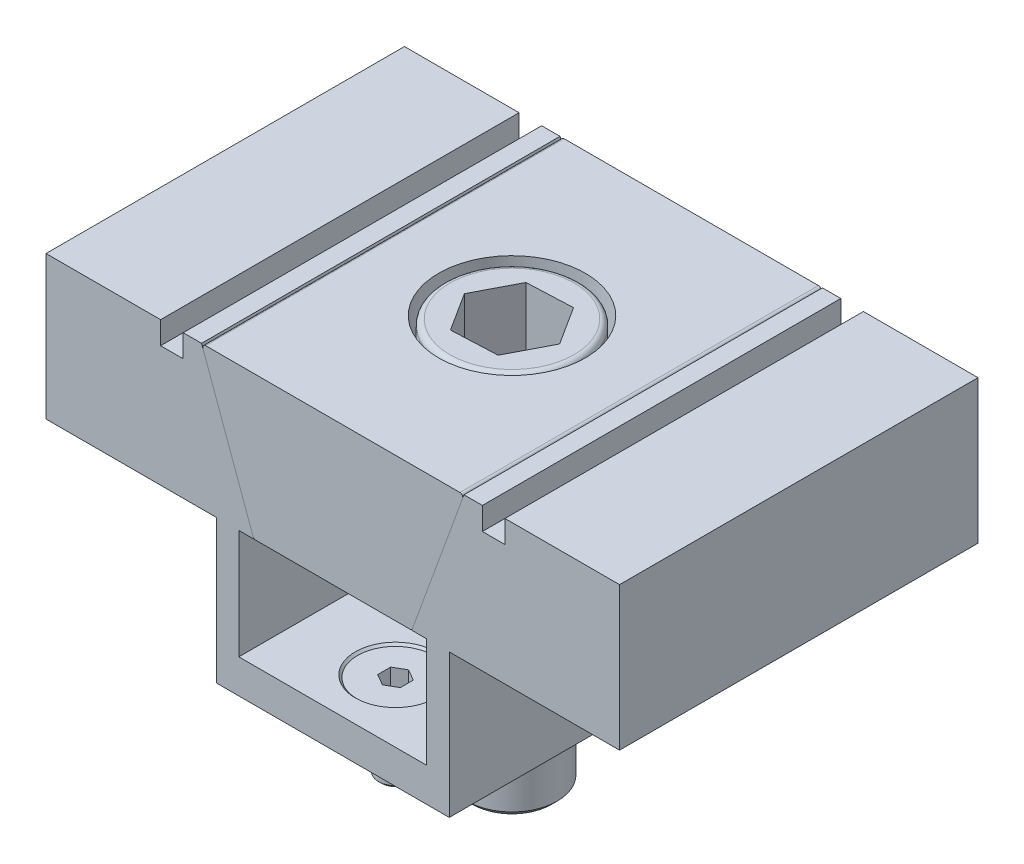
ISO-10303-21;
HEADER;
FILE_DESCRIPTION(('STEP AP214'),'2;1');
FILE_NAME('part.step','',(''),(''),'','','');
FILE_SCHEMA(('AUTOMOTIVE_DESIGN { 1 0 10303 214 1 1 1 1 }'));
ENDSEC;
DATA;
#1=APPLICATION_CONTEXT('core data for automotive mechanical design processes');
#2=APPLICATION_PROTOCOL_DEFINITION('international standard','automotive_design',2000,#1);
#3=PRODUCT_CONTEXT('',#1,'mechanical');
#4=PRODUCT('Part','Part','',(#3));
#5=PRODUCT_RELATED_PRODUCT_CATEGORY('part','',(#4));
#6=PRODUCT_DEFINITION_FORMATION('','',#4);
#7=PRODUCT_DEFINITION_CONTEXT('part definition',#1,'design');
#8=PRODUCT_DEFINITION('design','',#6,#7);
#9=PRODUCT_DEFINITION_SHAPE('','',#8);
#10=(LENGTH_UNIT() NAMED_UNIT(*) SI_UNIT(.MILLI.,.METRE.));
#11=(NAMED_UNIT(*) PLANE_ANGLE_UNIT() SI_UNIT($,.RADIAN.));
#12=(NAMED_UNIT(*) SI_UNIT($,.STERADIAN.) SOLID_ANGLE_UNIT());
#13=UNCERTAINTY_MEASURE_WITH_UNIT(LENGTH_MEASURE(1.E-05),#10,'distance_accuracy_value','');
#14=(GEOMETRIC_REPRESENTATION_CONTEXT(3) GLOBAL_UNCERTAINTY_ASSIGNED_CONTEXT((#13)) GLOBAL_UNIT_ASSIGNED_CONTEXT((#10,
#11,#12)) REPRESENTATION_CONTEXT('',''));
#15=CARTESIAN_POINT('',(0.,0.,0.));
#16=DIRECTION('',(0.,0.,1.));
#17=DIRECTION('',(1.,0.,0.));
#18=AXIS2_PLACEMENT_3D('',#15,#16,#17);
#19=CARTESIAN_POINT('',(0.,-23.7800000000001,18.3305989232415));
#20=DIRECTION('',(0.,1.,0.));
#21=DIRECTION('',(0.,0.,1.));
#22=AXIS2_PLACEMENT_3D('',#19,#20,#21);
#23=PLANE('',#22);
#24=DIRECTION('',(0.866025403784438,0.,0.5));
#25=VECTOR('',#24,1.);
#26=CARTESIAN_POINT('',(-2.,-23.7800000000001,21.7947005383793));
#27=LINE('',#26,#25);
#28=CARTESIAN_POINT('',(-2.,-23.7800000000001,21.7947005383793));
#29=VERTEX_POINT('',#28);
#30=CARTESIAN_POINT('',(-1.,-23.7800000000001,22.3720508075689));
#31=VERTEX_POINT('',#30);
#32=EDGE_CURVE('P0_E174',#29,#31,#27,.T.);
#33=ORIENTED_EDGE('',*,*,#32,.T.);
#34=CARTESIAN_POINT('',(0.,-23.7800000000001,20.64));
#35=DIRECTION('',(0.,1.,0.));
#36=DIRECTION('',(0.,0.,1.));
#37=AXIS2_PLACEMENT_3D('',#34,#35,#36);
#38=CIRCLE('',#37,2.);
#39=CARTESIAN_POINT('',(-2.,-23.7800000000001,20.64));
#40=VERTEX_POINT('',#39);
#41=EDGE_CURVE('P0_E11',#31,#40,#38,.F.);
#42=ORIENTED_EDGE('',*,*,#41,.T.);
#43=DIRECTION('',(0.,0.,1.));
#44=VECTOR('',#43,1.);
#45=CARTESIAN_POINT('',(-2.,-23.7800000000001,19.4852994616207));
#46=LINE('',#45,#44);
#47=EDGE_CURVE('P0_E178',#40,#29,#46,.T.);
#48=ORIENTED_EDGE('',*,*,#47,.T.);
#49=EDGE_LOOP('',(#33,#42,#48));
#50=FACE_BOUND('',#49,.T.);
#51=ADVANCED_FACE('P0_F16',(#50),#23,.T.);
#52=CARTESIAN_POINT('',(-2.,-23.7800000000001,19.4852994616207));
#53=VERTEX_POINT('',#52);
#54=EDGE_CURVE('P0_E175',#53,#40,#46,.T.);
#55=ORIENTED_EDGE('',*,*,#54,.T.);
#56=CARTESIAN_POINT('',(-1.,-23.7800000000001,18.9079491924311));
#57=VERTEX_POINT('',#56);
#58=EDGE_CURVE('P0_E25',#40,#57,#38,.F.);
#59=ORIENTED_EDGE('',*,*,#58,.T.);
#60=DIRECTION('',(-0.866025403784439,0.,0.5));
#61=VECTOR('',#60,1.);
#62=CARTESIAN_POINT('',(0.,-23.7800000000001,18.3305989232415));
#63=LINE('',#62,#61);
#64=EDGE_CURVE('P0_E186',#57,#53,#63,.T.);
#65=ORIENTED_EDGE('',*,*,#64,.T.);
#66=EDGE_LOOP('',(#55,#59,#65));
#67=FACE_BOUND('',#66,.T.);
#68=ADVANCED_FACE('P0_F199',(#67),#23,.T.);
#69=CARTESIAN_POINT('',(0.,-23.7800000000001,18.3305989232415));
#70=VERTEX_POINT('',#69);
#71=EDGE_CURVE('P0_E183',#70,#57,#63,.T.);
#72=ORIENTED_EDGE('',*,*,#71,.T.);
#73=CARTESIAN_POINT('',(0.999999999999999,-23.7800000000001,18.9079491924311));
#74=VERTEX_POINT('',#73);
#75=EDGE_CURVE('P0_E109',#57,#74,#38,.F.);
#76=ORIENTED_EDGE('',*,*,#75,.T.);
#77=DIRECTION('',(-0.866025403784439,0.,-0.5));
#78=VECTOR('',#77,1.);
#79=CARTESIAN_POINT('',(2.,-23.7800000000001,19.4852994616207));
#80=LINE('',#79,#78);
#81=EDGE_CURVE('P0_E142',#74,#70,#80,.T.);
#82=ORIENTED_EDGE('',*,*,#81,.T.);
#83=EDGE_LOOP('',(#72,#76,#82));
#84=FACE_BOUND('',#83,.T.);
#85=ADVANCED_FACE('P0_F189',(#84),#23,.T.);
#86=CARTESIAN_POINT('',(2.,-23.7800000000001,19.4852994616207));
#87=VERTEX_POINT('',#86);
#88=EDGE_CURVE('P0_E108',#87,#74,#80,.T.);
#89=ORIENTED_EDGE('',*,*,#88,.T.);
#90=CARTESIAN_POINT('',(2.,-23.7800000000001,20.64));
#91=VERTEX_POINT('',#90);
#92=EDGE_CURVE('P0_E95',#74,#91,#38,.F.);
#93=ORIENTED_EDGE('',*,*,#92,.T.);
#94=DIRECTION('',(0.,0.,-1.));
#95=VECTOR('',#94,1.);
#96=CARTESIAN_POINT('',(2.,-23.7800000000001,21.7947005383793));
#97=LINE('',#96,#95);
#98=EDGE_CURVE('P0_E105',#91,#87,#97,.T.);
#99=ORIENTED_EDGE('',*,*,#98,.T.);
#100=EDGE_LOOP('',(#89,#93,#99));
#101=FACE_BOUND('',#100,.T.);
#102=ADVANCED_FACE('P0_F104',(#101),#23,.T.);
#103=CARTESIAN_POINT('',(2.,-23.7800000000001,21.7947005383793));
#104=VERTEX_POINT('',#103);
#105=EDGE_CURVE('P0_E114',#104,#91,#97,.T.);
#106=ORIENTED_EDGE('',*,*,#105,.T.);
#107=CARTESIAN_POINT('',(0.,-23.7800000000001,20.64));
#108=DIRECTION('',(0.,-1.,0.));
#109=DIRECTION('',(1.,0.,0.));
#110=AXIS2_PLACEMENT_3D('',#107,#108,#109);
#111=CIRCLE('',#110,2.);
#112=CARTESIAN_POINT('',(0.999999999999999,-23.7800000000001,22.3720508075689));
#113=VERTEX_POINT('',#112);
#114=EDGE_CURVE('P0_E93',#91,#113,#111,.T.);
#115=ORIENTED_EDGE('',*,*,#114,.T.);
#116=DIRECTION('',(0.866025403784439,0.,-0.5));
#117=VECTOR('',#116,1.);
#118=CARTESIAN_POINT('',(0.,-23.7800000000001,22.9494010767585));
#119=LINE('',#118,#117);
#120=EDGE_CURVE('P0_E119',#113,#104,#119,.T.);
#121=ORIENTED_EDGE('',*,*,#120,.T.);
#122=EDGE_LOOP('',(#106,#115,#121));
#123=FACE_BOUND('',#122,.T.);
#124=ADVANCED_FACE('P0_F118',(#123),#23,.T.);
#125=CARTESIAN_POINT('',(0.,-23.7800000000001,22.9494010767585));
#126=VERTEX_POINT('',#125);
#127=EDGE_CURVE('P0_E116',#126,#113,#119,.T.);
#128=ORIENTED_EDGE('',*,*,#127,.T.);
#129=EDGE_CURVE('P0_E20',#113,#31,#38,.F.);
#130=ORIENTED_EDGE('',*,*,#129,.T.);
#131=EDGE_CURVE('P0_E167',#31,#126,#27,.T.);
#132=ORIENTED_EDGE('',*,*,#131,.T.);
#133=EDGE_LOOP('',(#128,#130,#132));
#134=FACE_BOUND('',#133,.T.);
#135=ADVANCED_FACE('P0_F166',(#134),#23,.T.);
#136=CARTESIAN_POINT('',(0.,-34.7800000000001,20.64));
#137=DIRECTION('',(0.,1.,0.));
#138=DIRECTION('',(0.,0.,1.));
#139=AXIS2_PLACEMENT_3D('',#136,#137,#138);
#140=CYLINDRICAL_SURFACE('',#139,3.);
#141=CARTESIAN_POINT('',(0.,-34.2800000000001,20.64));
#142=DIRECTION('',(0.,1.,0.));
#143=DIRECTION('',(0.,0.,1.));
#144=AXIS2_PLACEMENT_3D('',#141,#142,#143);
#145=CIRCLE('',#144,3.);
#146=CARTESIAN_POINT('',(0.,-34.2800000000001,23.64));
#147=VERTEX_POINT('',#146);
#148=EDGE_CURVE('P0_E157',#147,#147,#145,.T.);
#149=ORIENTED_EDGE('',*,*,#148,.T.);
#150=EDGE_LOOP('',(#149));
#151=FACE_BOUND('',#150,.T.);
#152=CARTESIAN_POINT('',(0.,-23.5000000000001,20.64));
#153=DIRECTION('',(0.,1.,0.));
#154=DIRECTION('',(-1.,0.,0.));
#155=AXIS2_PLACEMENT_3D('',#152,#153,#154);
#156=CIRCLE('',#155,3.);
#157=CARTESIAN_POINT('',(-3.,-23.5000000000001,20.64));
#158=VERTEX_POINT('',#157);
#159=EDGE_CURVE('P0_E154',#158,#158,#156,.F.);
#160=ORIENTED_EDGE('',*,*,#159,.T.);
#161=EDGE_LOOP('',(#160));
#162=FACE_BOUND('',#161,.T.);
#163=ADVANCED_FACE('P0_F226',(#151,#162),#140,.T.);
#164=CARTESIAN_POINT('',(0.,-34.7800000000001,20.64));
#165=DIRECTION('',(0.,1.,0.));
#166=DIRECTION('',(0.,0.,1.));
#167=AXIS2_PLACEMENT_3D('',#164,#165,#166);
#168=PLANE('',#167);
#169=CARTESIAN_POINT('',(0.,-34.7800000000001,20.64));
#170=DIRECTION('',(0.,1.,0.));
#171=DIRECTION('',(0.,0.,1.));
#172=AXIS2_PLACEMENT_3D('',#169,#170,#171);
#173=CIRCLE('',#172,2.5);
#174=CARTESIAN_POINT('',(0.,-34.7800000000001,23.14));
#175=VERTEX_POINT('',#174);
#176=EDGE_CURVE('P0_E159',#175,#175,#173,.F.);
#177=ORIENTED_EDGE('',*,*,#176,.T.);
#178=EDGE_LOOP('',(#177));
#179=FACE_BOUND('',#178,.T.);
#180=ADVANCED_FACE('P0_F231',(#179),#168,.F.);
#181=CARTESIAN_POINT('',(0.,-19.7800000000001,20.64));
#182=DIRECTION('',(0.,1.,0.));
#183=DIRECTION('',(-1.,0.,0.));
#184=AXIS2_PLACEMENT_3D('',#181,#182,#183);
#185=CONICAL_SURFACE('',#184,6.72,0.785398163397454);
#186=ORIENTED_EDGE('',*,*,#159,.F.);
#187=EDGE_LOOP('',(#186));
#188=FACE_BOUND('',#187,.T.);
#189=CARTESIAN_POINT('',(0.,-19.7800000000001,20.64));
#190=DIRECTION('',(0.,-1.,0.));
#191=DIRECTION('',(1.,0.,0.));
#192=AXIS2_PLACEMENT_3D('',#189,#190,#191);
#193=CIRCLE('',#192,6.72);
#194=CARTESIAN_POINT('',(6.72,-19.7800000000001,20.64));
#195=VERTEX_POINT('',#194);
#196=EDGE_CURVE('P0_E144',#195,#195,#193,.T.);
#197=ORIENTED_EDGE('',*,*,#196,.T.);
#198=EDGE_LOOP('',(#197));
#199=FACE_BOUND('',#198,.T.);
#200=ADVANCED_FACE('P0_F286',(#188,#199),#185,.T.);
#201=CARTESIAN_POINT('',(0.,-19.7800000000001,20.64));
#202=DIRECTION('',(0.,1.,0.));
#203=DIRECTION('',(0.,0.,1.));
#204=AXIS2_PLACEMENT_3D('',#201,#202,#203);
#205=PLANE('',#204);
#206=DIRECTION('',(-0.866025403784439,0.,-0.5));
#207=VECTOR('',#206,1.);
#208=CARTESIAN_POINT('',(2.,-19.7800000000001,19.4852994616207));
#209=LINE('',#208,#207);
#210=CARTESIAN_POINT('',(2.,-19.7800000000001,19.4852994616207));
#211=VERTEX_POINT('',#210);
#212=CARTESIAN_POINT('',(0.,-19.7800000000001,18.3305989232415));
#213=VERTEX_POINT('',#212);
#214=EDGE_CURVE('P0_E38',#211,#213,#209,.T.);
#215=ORIENTED_EDGE('',*,*,#214,.F.);
#216=DIRECTION('',(0.,0.,-1.));
#217=VECTOR('',#216,1.);
#218=CARTESIAN_POINT('',(2.,-19.7800000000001,21.7947005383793));
#219=LINE('',#218,#217);
#220=CARTESIAN_POINT('',(2.,-19.7800000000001,21.7947005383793));
#221=VERTEX_POINT('',#220);
#222=EDGE_CURVE('P0_E140',#221,#211,#219,.T.);
#223=ORIENTED_EDGE('',*,*,#222,.F.);
#224=DIRECTION('',(0.866025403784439,0.,-0.5));
#225=VECTOR('',#224,1.);
#226=CARTESIAN_POINT('',(0.,-19.7800000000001,22.9494010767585));
#227=LINE('',#226,#225);
#228=CARTESIAN_POINT('',(0.,-19.7800000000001,22.9494010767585));
#229=VERTEX_POINT('',#228);
#230=EDGE_CURVE('P0_E137',#229,#221,#227,.T.);
#231=ORIENTED_EDGE('',*,*,#230,.F.);
#232=DIRECTION('',(0.866025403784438,0.,0.5));
#233=VECTOR('',#232,1.);
#234=CARTESIAN_POINT('',(-2.,-19.7800000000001,21.7947005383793));
#235=LINE('',#234,#233);
#236=CARTESIAN_POINT('',(-2.,-19.7800000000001,21.7947005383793));
#237=VERTEX_POINT('',#236);
#238=EDGE_CURVE('P0_E134',#237,#229,#235,.T.);
#239=ORIENTED_EDGE('',*,*,#238,.F.);
#240=DIRECTION('',(0.,0.,1.));
#241=VECTOR('',#240,1.);
#242=CARTESIAN_POINT('',(-2.,-19.7800000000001,19.4852994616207));
#243=LINE('',#242,#241);
#244=CARTESIAN_POINT('',(-2.,-19.7800000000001,19.4852994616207));
#245=VERTEX_POINT('',#244);
#246=EDGE_CURVE('P0_E131',#245,#237,#243,.T.);
#247=ORIENTED_EDGE('',*,*,#246,.F.);
#248=DIRECTION('',(-0.866025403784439,0.,0.5));
#249=VECTOR('',#248,1.);
#250=CARTESIAN_POINT('',(0.,-19.7800000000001,18.3305989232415));
#251=LINE('',#250,#249);
#252=EDGE_CURVE('P0_E128',#213,#245,#251,.T.);
#253=ORIENTED_EDGE('',*,*,#252,.F.);
#254=EDGE_LOOP('',(#215,#223,#231,#239,#247,#253));
#255=FACE_BOUND('',#254,.T.);
#256=ORIENTED_EDGE('',*,*,#196,.F.);
#257=EDGE_LOOP('',(#256));
#258=FACE_BOUND('',#257,.T.);
#259=ADVANCED_FACE('P0_F207',(#255,#258),#205,.T.);
#260=CARTESIAN_POINT('',(0.,-34.2800000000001,20.64));
#261=DIRECTION('',(0.,1.,0.));
#262=DIRECTION('',(0.,0.,1.));
#263=AXIS2_PLACEMENT_3D('',#260,#261,#262);
#264=CONICAL_SURFACE('',#263,3.,0.785398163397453);
#265=ORIENTED_EDGE('',*,*,#176,.F.);
#266=EDGE_LOOP('',(#265));
#267=FACE_BOUND('',#266,.T.);
#268=ORIENTED_EDGE('',*,*,#148,.F.);
#269=EDGE_LOOP('',(#268));
#270=FACE_BOUND('',#269,.T.);
#271=ADVANCED_FACE('P0_F18',(#267,#270),#264,.T.);
#272=CARTESIAN_POINT('',(2.,-23.7800000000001,19.4852994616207));
#273=DIRECTION('',(0.5,0.,-0.866025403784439));
#274=DIRECTION('',(-0.866025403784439,0.,-0.5));
#275=AXIS2_PLACEMENT_3D('',#272,#273,#274);
#276=PLANE('',#275);
#277=ORIENTED_EDGE('',*,*,#214,.T.);
#278=DIRECTION('',(0.,1.,0.));
#279=VECTOR('',#278,1.);
#280=CARTESIAN_POINT('',(0.,-23.7800000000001,18.3305989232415));
#281=LINE('',#280,#279);
#282=EDGE_CURVE('P0_E121',#70,#213,#281,.T.);
#283=ORIENTED_EDGE('',*,*,#282,.F.);
#284=ORIENTED_EDGE('',*,*,#81,.F.);
#285=ORIENTED_EDGE('',*,*,#88,.F.);
#286=DIRECTION('',(0.,1.,0.));
#287=VECTOR('',#286,1.);
#288=CARTESIAN_POINT('',(2.,-23.7800000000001,19.4852994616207));
#289=LINE('',#288,#287);
#290=EDGE_CURVE('P0_E115',#87,#211,#289,.T.);
#291=ORIENTED_EDGE('',*,*,#290,.T.);
#292=EDGE_LOOP('',(#277,#283,#284,#285,#291));
#293=FACE_BOUND('',#292,.T.);
#294=ADVANCED_FACE('P0_F191',(#293),#276,.F.);
#295=CARTESIAN_POINT('',(2.,-23.7800000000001,21.7947005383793));
#296=DIRECTION('',(1.,0.,0.));
#297=DIRECTION('',(0.,0.,-1.));
#298=AXIS2_PLACEMENT_3D('',#295,#296,#297);
#299=PLANE('',#298);
#300=ORIENTED_EDGE('',*,*,#222,.T.);
#301=ORIENTED_EDGE('',*,*,#290,.F.);
#302=ORIENTED_EDGE('',*,*,#98,.F.);
#303=ORIENTED_EDGE('',*,*,#105,.F.);
#304=DIRECTION('',(0.,1.,0.));
#305=VECTOR('',#304,1.);
#306=CARTESIAN_POINT('',(2.,-23.7800000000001,21.7947005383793));
#307=LINE('',#306,#305);
#308=EDGE_CURVE('P0_E145',#104,#221,#307,.T.);
#309=ORIENTED_EDGE('',*,*,#308,.T.);
#310=EDGE_LOOP('',(#300,#301,#302,#303,#309));
#311=FACE_BOUND('',#310,.T.);
#312=ADVANCED_FACE('P0_F113',(#311),#299,.F.);
#313=CARTESIAN_POINT('',(0.,-23.7800000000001,22.9494010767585));
#314=DIRECTION('',(0.5,0.,0.866025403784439));
#315=DIRECTION('',(0.866025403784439,0.,-0.5));
#316=AXIS2_PLACEMENT_3D('',#313,#314,#315);
#317=PLANE('',#316);
#318=ORIENTED_EDGE('',*,*,#230,.T.);
#319=ORIENTED_EDGE('',*,*,#308,.F.);
#320=ORIENTED_EDGE('',*,*,#120,.F.);
#321=ORIENTED_EDGE('',*,*,#127,.F.);
#322=DIRECTION('',(0.,1.,0.));
#323=VECTOR('',#322,1.);
#324=CARTESIAN_POINT('',(0.,-23.7800000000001,22.9494010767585));
#325=LINE('',#324,#323);
#326=EDGE_CURVE('P0_E147',#126,#229,#325,.T.);
#327=ORIENTED_EDGE('',*,*,#326,.T.);
#328=EDGE_LOOP('',(#318,#319,#320,#321,#327));
#329=FACE_BOUND('',#328,.T.);
#330=ADVANCED_FACE('P0_F210',(#329),#317,.F.);
#331=CARTESIAN_POINT('',(-2.,-23.7800000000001,21.7947005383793));
#332=DIRECTION('',(-0.5,0.,0.866025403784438));
#333=DIRECTION('',(0.866025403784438,0.,0.5));
#334=AXIS2_PLACEMENT_3D('',#331,#332,#333);
#335=PLANE('',#334);
#336=ORIENTED_EDGE('',*,*,#238,.T.);
#337=ORIENTED_EDGE('',*,*,#326,.F.);
#338=ORIENTED_EDGE('',*,*,#131,.F.);
#339=ORIENTED_EDGE('',*,*,#32,.F.);
#340=DIRECTION('',(0.,1.,0.));
#341=VECTOR('',#340,1.);
#342=CARTESIAN_POINT('',(-2.,-23.7800000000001,21.7947005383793));
#343=LINE('',#342,#341);
#344=EDGE_CURVE('P0_E149',#29,#237,#343,.T.);
#345=ORIENTED_EDGE('',*,*,#344,.T.);
#346=EDGE_LOOP('',(#336,#337,#338,#339,#345));
#347=FACE_BOUND('',#346,.T.);
#348=ADVANCED_FACE('P0_F173',(#347),#335,.F.);
#349=CARTESIAN_POINT('',(-2.,-23.7800000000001,19.4852994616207));
#350=DIRECTION('',(-1.,0.,0.));
#351=DIRECTION('',(0.,0.,1.));
#352=AXIS2_PLACEMENT_3D('',#349,#350,#351);
#353=PLANE('',#352);
#354=ORIENTED_EDGE('',*,*,#246,.T.);
#355=ORIENTED_EDGE('',*,*,#344,.F.);
#356=ORIENTED_EDGE('',*,*,#47,.F.);
#357=ORIENTED_EDGE('',*,*,#54,.F.);
#358=DIRECTION('',(0.,1.,0.));
#359=VECTOR('',#358,1.);
#360=CARTESIAN_POINT('',(-2.,-23.7800000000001,19.4852994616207));
#361=LINE('',#360,#359);
#362=EDGE_CURVE('P0_E122',#53,#245,#361,.T.);
#363=ORIENTED_EDGE('',*,*,#362,.T.);
#364=EDGE_LOOP('',(#354,#355,#356,#357,#363));
#365=FACE_BOUND('',#364,.T.);
#366=ADVANCED_FACE('P0_F201',(#365),#353,.F.);
#367=CARTESIAN_POINT('',(0.,-23.7800000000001,18.3305989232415));
#368=DIRECTION('',(-0.5,0.,-0.866025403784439));
#369=DIRECTION('',(-0.866025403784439,0.,0.5));
#370=AXIS2_PLACEMENT_3D('',#367,#368,#369);
#371=PLANE('',#370);
#372=ORIENTED_EDGE('',*,*,#252,.T.);
#373=ORIENTED_EDGE('',*,*,#362,.F.);
#374=ORIENTED_EDGE('',*,*,#64,.F.);
#375=ORIENTED_EDGE('',*,*,#71,.F.);
#376=ORIENTED_EDGE('',*,*,#282,.T.);
#377=EDGE_LOOP('',(#372,#373,#374,#375,#376));
#378=FACE_BOUND('',#377,.T.);
#379=ADVANCED_FACE('P0_F90',(#378),#371,.F.);
#380=CARTESIAN_POINT('',(0.,-23.7800000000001,20.64));
#381=DIRECTION('',(0.,1.,0.));
#382=DIRECTION('',(-1.,0.,0.));
#383=AXIS2_PLACEMENT_3D('',#380,#381,#382);
#384=CONICAL_SURFACE('',#383,2.,1.0471975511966);
#385=CARTESIAN_POINT('',(0.,-24.9347005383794,20.64));
#386=VERTEX_POINT('',#385);
#387=VERTEX_LOOP('',#386);
#388=FACE_BOUND('',#387,.T.);
#389=ORIENTED_EDGE('',*,*,#114,.F.);
#390=ORIENTED_EDGE('',*,*,#92,.F.);
#391=ORIENTED_EDGE('',*,*,#75,.F.);
#392=ORIENTED_EDGE('',*,*,#58,.F.);
#393=ORIENTED_EDGE('',*,*,#41,.F.);
#394=ORIENTED_EDGE('',*,*,#129,.F.);
#395=EDGE_LOOP('',(#389,#390,#391,#392,#393,#394));
#396=FACE_BOUND('',#395,.T.);
#397=ADVANCED_FACE('P0_F88',(#388,#396),#384,.F.);
#398=CLOSED_SHELL('',(#51,#68,#85,#102,#124,#135,#163,#180,#200,#259,#271,#294,#312,#330,#348,
#366,#379,#397));
#399=MANIFOLD_SOLID_BREP('P0_B1',#398);
#400=CARTESIAN_POINT('',(0.,8.90000000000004,0.));
#401=DIRECTION('',(0.,-1.,0.));
#402=DIRECTION('',(-0.887264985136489,0.,-0.461260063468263));
#403=AXIS2_PLACEMENT_3D('',#400,#401,#402);
#404=CYLINDRICAL_SURFACE('',#403,8.);
#405=CARTESIAN_POINT('',(0.,-45.1,0.));
#406=DIRECTION('',(0.,1.,0.));
#407=DIRECTION('',(0.887264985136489,0.,0.461260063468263));
#408=AXIS2_PLACEMENT_3D('',#405,#406,#407);
#409=CIRCLE('',#408,8.);
#410=CARTESIAN_POINT('',(7.09811988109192,-45.1,3.6900805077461));
#411=VERTEX_POINT('',#410);
#412=EDGE_CURVE('P1_E24',#411,#411,#409,.T.);
#413=ORIENTED_EDGE('',*,*,#412,.T.);
#414=EDGE_LOOP('',(#413));
#415=FACE_BOUND('',#414,.T.);
#416=CARTESIAN_POINT('',(0.,8.90000000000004,0.));
#417=DIRECTION('',(0.,1.,0.));
#418=DIRECTION('',(0.887264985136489,0.,0.461260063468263));
#419=AXIS2_PLACEMENT_3D('',#416,#417,#418);
#420=CIRCLE('',#419,8.);
#421=CARTESIAN_POINT('',(7.09811988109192,8.90000000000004,3.6900805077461));
#422=VERTEX_POINT('',#421);
#423=EDGE_CURVE('P1_E126',#422,#422,#420,.T.);
#424=ORIENTED_EDGE('',*,*,#423,.F.);
#425=EDGE_LOOP('',(#424));
#426=FACE_BOUND('',#425,.T.);
#427=ADVANCED_FACE('P1_F16',(#415,#426),#404,.T.);
#428=CARTESIAN_POINT('',(0.,-46.1,0.));
#429=DIRECTION('',(0.,1.,0.));
#430=DIRECTION('',(0.887264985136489,0.,0.461260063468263));
#431=AXIS2_PLACEMENT_3D('',#428,#429,#430);
#432=PLANE('',#431);
#433=CARTESIAN_POINT('',(0.,-46.1,0.));
#434=DIRECTION('',(0.,1.,0.));
#435=DIRECTION('',(0.887264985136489,0.,0.461260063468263));
#436=AXIS2_PLACEMENT_3D('',#433,#434,#435);
#437=CIRCLE('',#436,7.00000000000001);
#438=CARTESIAN_POINT('',(6.21085489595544,-46.1,3.22882044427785));
#439=VERTEX_POINT('',#438);
#440=EDGE_CURVE('P1_E11',#439,#439,#437,.F.);
#441=ORIENTED_EDGE('',*,*,#440,.T.);
#442=EDGE_LOOP('',(#441));
#443=FACE_BOUND('',#442,.T.);
#444=ADVANCED_FACE('P1_F149',(#443),#432,.F.);
#445=CARTESIAN_POINT('',(0.,8.90000000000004,0.));
#446=DIRECTION('',(0.,1.,0.));
#447=DIRECTION('',(0.887264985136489,0.,0.461260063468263));
#448=AXIS2_PLACEMENT_3D('',#445,#446,#447);
#449=PLANE('',#448);
#450=CARTESIAN_POINT('',(0.,8.90000000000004,0.));
#451=DIRECTION('',(0.,1.,0.));
#452=DIRECTION('',(0.887264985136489,0.,0.461260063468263));
#453=AXIS2_PLACEMENT_3D('',#450,#451,#452);
#454=CIRCLE('',#453,12.);
#455=CARTESIAN_POINT('',(10.6471798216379,8.90000000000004,5.53512076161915));
#456=VERTEX_POINT('',#455);
#457=EDGE_CURVE('P1_E118',#456,#456,#454,.T.);
#458=ORIENTED_EDGE('',*,*,#457,.F.);
#459=EDGE_LOOP('',(#458));
#460=FACE_BOUND('',#459,.T.);
#461=ORIENTED_EDGE('',*,*,#423,.T.);
#462=EDGE_LOOP('',(#461));
#463=FACE_BOUND('',#462,.T.);
#464=ADVANCED_FACE('P1_F154',(#460,#463),#449,.F.);
#465=CARTESIAN_POINT('',(0.,24.9,0.));
#466=DIRECTION('',(0.,-1.,0.));
#467=DIRECTION('',(-0.887264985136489,0.,-0.461260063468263));
#468=AXIS2_PLACEMENT_3D('',#465,#466,#467);
#469=CYLINDRICAL_SURFACE('',#468,12.);
#470=CARTESIAN_POINT('',(0.,23.9,0.));
#471=DIRECTION('',(0.,1.,0.));
#472=DIRECTION('',(0.887264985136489,0.,0.461260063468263));
#473=AXIS2_PLACEMENT_3D('',#470,#471,#472);
#474=CIRCLE('',#473,12.);
#475=CARTESIAN_POINT('',(10.6471798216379,23.9,5.53512076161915));
#476=VERTEX_POINT('',#475);
#477=EDGE_CURVE('P1_E132',#476,#476,#474,.F.);
#478=ORIENTED_EDGE('',*,*,#477,.T.);
#479=EDGE_LOOP('',(#478));
#480=FACE_BOUND('',#479,.T.);
#481=ORIENTED_EDGE('',*,*,#457,.T.);
#482=EDGE_LOOP('',(#481));
#483=FACE_BOUND('',#482,.T.);
#484=ADVANCED_FACE('P1_F158',(#480,#483),#469,.T.);
#485=CARTESIAN_POINT('',(0.,24.9,0.));
#486=DIRECTION('',(0.,1.,0.));
#487=DIRECTION('',(0.887264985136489,0.,0.461260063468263));
#488=AXIS2_PLACEMENT_3D('',#485,#486,#487);
#489=PLANE('',#488);
#490=CARTESIAN_POINT('',(0.,24.9,0.));
#491=DIRECTION('',(0.,1.,0.));
#492=DIRECTION('',(0.887264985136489,0.,0.461260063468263));
#493=AXIS2_PLACEMENT_3D('',#490,#491,#492);
#494=CIRCLE('',#493,11.);
#495=CARTESIAN_POINT('',(9.75991483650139,24.9,5.07386069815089));
#496=VERTEX_POINT('',#495);
#497=EDGE_CURVE('P1_E129',#496,#496,#494,.T.);
#498=ORIENTED_EDGE('',*,*,#497,.T.);
#499=EDGE_LOOP('',(#498));
#500=FACE_BOUND('',#499,.T.);
#501=DIRECTION('',(-0.999024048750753,0.,0.044169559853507));
#502=VECTOR('',#501,1.);
#503=CARTESIAN_POINT('',(3.72832070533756,24.9,-7.17167749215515));
#504=LINE('',#503,#502);
#505=CARTESIAN_POINT('',(3.72832070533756,24.9,-7.17167749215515));
#506=VERTEX_POINT('',#505);
#507=CARTESIAN_POINT('',(-4.34669454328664,24.9,-6.81465919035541));
#508=VERTEX_POINT('',#507);
#509=EDGE_CURVE('P1_E31',#506,#508,#504,.T.);
#510=ORIENTED_EDGE('',*,*,#509,.F.);
#511=DIRECTION('',(-0.537763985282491,0.,-0.843095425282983));
#512=VECTOR('',#511,1.);
#513=CARTESIAN_POINT('',(8.07501524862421,24.9,-0.357018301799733));
#514=LINE('',#513,#512);
#515=CARTESIAN_POINT('',(8.07501524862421,24.9,-0.357018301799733));
#516=VERTEX_POINT('',#515);
#517=EDGE_CURVE('P1_E114',#516,#506,#514,.T.);
#518=ORIENTED_EDGE('',*,*,#517,.F.);
#519=DIRECTION('',(0.461260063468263,0.,-0.887264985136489));
#520=VECTOR('',#519,1.);
#521=CARTESIAN_POINT('',(4.34669454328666,24.9,6.81465919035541));
#522=LINE('',#521,#520);
#523=CARTESIAN_POINT('',(4.34669454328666,24.9,6.81465919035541));
#524=VERTEX_POINT('',#523);
#525=EDGE_CURVE('P1_E112',#524,#516,#522,.T.);
#526=ORIENTED_EDGE('',*,*,#525,.F.);
#527=DIRECTION('',(0.999024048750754,0.,-0.0441695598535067));
#528=VECTOR('',#527,1.);
#529=CARTESIAN_POINT('',(-3.72832070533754,24.9,7.17167749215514));
#530=LINE('',#529,#528);
#531=CARTESIAN_POINT('',(-3.72832070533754,24.9,7.17167749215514));
#532=VERTEX_POINT('',#531);
#533=EDGE_CURVE('P1_E79',#532,#524,#530,.T.);
#534=ORIENTED_EDGE('',*,*,#533,.F.);
#535=DIRECTION('',(0.537763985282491,0.,0.843095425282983));
#536=VECTOR('',#535,1.);
#537=CARTESIAN_POINT('',(-8.07501524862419,24.9,0.357018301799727));
#538=LINE('',#537,#536);
#539=CARTESIAN_POINT('',(-8.07501524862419,24.9,0.357018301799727));
#540=VERTEX_POINT('',#539);
#541=EDGE_CURVE('P1_E108',#540,#532,#538,.T.);
#542=ORIENTED_EDGE('',*,*,#541,.F.);
#543=DIRECTION('',(-0.461260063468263,0.,0.887264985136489));
#544=VECTOR('',#543,1.);
#545=CARTESIAN_POINT('',(-4.34669454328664,24.9,-6.81465919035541));
#546=LINE('',#545,#544);
#547=EDGE_CURVE('P1_E105',#508,#540,#546,.T.);
#548=ORIENTED_EDGE('',*,*,#547,.F.);
#549=EDGE_LOOP('',(#510,#518,#526,#534,#542,#548));
#550=FACE_BOUND('',#549,.T.);
#551=ADVANCED_FACE('P1_F161',(#500,#550),#489,.T.);
#552=CARTESIAN_POINT('',(3.72832070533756,10.9,-7.17167749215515));
#553=DIRECTION('',(-0.044169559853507,0.,-0.999024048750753));
#554=DIRECTION('',(-0.999024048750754,0.,0.044169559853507));
#555=AXIS2_PLACEMENT_3D('',#552,#553,#554);
#556=PLANE('',#555);
#557=ORIENTED_EDGE('',*,*,#509,.T.);
#558=DIRECTION('',(0.,1.,0.));
#559=VECTOR('',#558,1.);
#560=CARTESIAN_POINT('',(-4.34669454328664,10.9,-6.81465919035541));
#561=LINE('',#560,#559);
#562=CARTESIAN_POINT('',(-4.34669454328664,10.9,-6.81465919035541));
#563=VERTEX_POINT('',#562);
#564=EDGE_CURVE('P1_E61',#563,#508,#561,.T.);
#565=ORIENTED_EDGE('',*,*,#564,.F.);
#566=DIRECTION('',(-0.999024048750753,0.,0.044169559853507));
#567=VECTOR('',#566,1.);
#568=CARTESIAN_POINT('',(3.72832070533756,10.9,-7.17167749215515));
#569=LINE('',#568,#567);
#570=CARTESIAN_POINT('',(3.72832070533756,10.9,-7.17167749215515));
#571=VERTEX_POINT('',#570);
#572=EDGE_CURVE('P1_E116',#571,#563,#569,.T.);
#573=ORIENTED_EDGE('',*,*,#572,.F.);
#574=DIRECTION('',(0.,1.,0.));
#575=VECTOR('',#574,1.);
#576=CARTESIAN_POINT('',(3.72832070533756,10.9,-7.17167749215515));
#577=LINE('',#576,#575);
#578=EDGE_CURVE('P1_E39',#571,#506,#577,.T.);
#579=ORIENTED_EDGE('',*,*,#578,.T.);
#580=EDGE_LOOP('',(#557,#565,#573,#579));
#581=FACE_BOUND('',#580,.T.);
#582=ADVANCED_FACE('P1_F168',(#581),#556,.F.);
#583=CARTESIAN_POINT('',(8.07501524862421,10.9,-0.357018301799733));
#584=DIRECTION('',(0.843095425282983,0.,-0.537763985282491));
#585=DIRECTION('',(-0.537763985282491,0.,-0.843095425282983));
#586=AXIS2_PLACEMENT_3D('',#583,#584,#585);
#587=PLANE('',#586);
#588=ORIENTED_EDGE('',*,*,#517,.T.);
#589=ORIENTED_EDGE('',*,*,#578,.F.);
#590=DIRECTION('',(-0.537763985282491,0.,-0.843095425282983));
#591=VECTOR('',#590,1.);
#592=CARTESIAN_POINT('',(8.07501524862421,10.9,-0.357018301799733));
#593=LINE('',#592,#591);
#594=CARTESIAN_POINT('',(8.07501524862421,10.9,-0.357018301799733));
#595=VERTEX_POINT('',#594);
#596=EDGE_CURVE('P1_E91',#595,#571,#593,.T.);
#597=ORIENTED_EDGE('',*,*,#596,.F.);
#598=DIRECTION('',(0.,1.,0.));
#599=VECTOR('',#598,1.);
#600=CARTESIAN_POINT('',(8.07501524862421,10.9,-0.357018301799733));
#601=LINE('',#600,#599);
#602=EDGE_CURVE('P1_E83',#595,#516,#601,.T.);
#603=ORIENTED_EDGE('',*,*,#602,.T.);
#604=EDGE_LOOP('',(#588,#589,#597,#603));
#605=FACE_BOUND('',#604,.T.);
#606=ADVANCED_FACE('P1_F172',(#605),#587,.F.);
#607=CARTESIAN_POINT('',(4.34669454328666,10.9,6.81465919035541));
#608=DIRECTION('',(0.887264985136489,0.,0.461260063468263));
#609=DIRECTION('',(0.461260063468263,0.,-0.887264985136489));
#610=AXIS2_PLACEMENT_3D('',#607,#608,#609);
#611=PLANE('',#610);
#612=ORIENTED_EDGE('',*,*,#525,.T.);
#613=ORIENTED_EDGE('',*,*,#602,.F.);
#614=DIRECTION('',(0.461260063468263,0.,-0.887264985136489));
#615=VECTOR('',#614,1.);
#616=CARTESIAN_POINT('',(4.34669454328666,10.9,6.81465919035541));
#617=LINE('',#616,#615);
#618=CARTESIAN_POINT('',(4.34669454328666,10.9,6.81465919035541));
#619=VERTEX_POINT('',#618);
#620=EDGE_CURVE('P1_E87',#619,#595,#617,.T.);
#621=ORIENTED_EDGE('',*,*,#620,.F.);
#622=DIRECTION('',(0.,1.,0.));
#623=VECTOR('',#622,1.);
#624=CARTESIAN_POINT('',(4.34669454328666,10.9,6.81465919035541));
#625=LINE('',#624,#623);
#626=EDGE_CURVE('P1_E72',#619,#524,#625,.T.);
#627=ORIENTED_EDGE('',*,*,#626,.T.);
#628=EDGE_LOOP('',(#612,#613,#621,#627));
#629=FACE_BOUND('',#628,.T.);
#630=ADVANCED_FACE('P1_F88',(#629),#611,.F.);
#631=CARTESIAN_POINT('',(-3.72832070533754,10.9,7.17167749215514));
#632=DIRECTION('',(0.0441695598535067,0.,0.999024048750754));
#633=DIRECTION('',(0.999024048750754,0.,-0.0441695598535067));
#634=AXIS2_PLACEMENT_3D('',#631,#632,#633);
#635=PLANE('',#634);
#636=ORIENTED_EDGE('',*,*,#533,.T.);
#637=ORIENTED_EDGE('',*,*,#626,.F.);
#638=DIRECTION('',(0.999024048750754,0.,-0.0441695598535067));
#639=VECTOR('',#638,1.);
#640=CARTESIAN_POINT('',(-3.72832070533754,10.9,7.17167749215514));
#641=LINE('',#640,#639);
#642=CARTESIAN_POINT('',(-3.72832070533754,10.9,7.17167749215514));
#643=VERTEX_POINT('',#642);
#644=EDGE_CURVE('P1_E76',#643,#619,#641,.T.);
#645=ORIENTED_EDGE('',*,*,#644,.F.);
#646=DIRECTION('',(0.,1.,0.));
#647=VECTOR('',#646,1.);
#648=CARTESIAN_POINT('',(-3.72832070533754,10.9,7.17167749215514));
#649=LINE('',#648,#647);
#650=EDGE_CURVE('P1_E84',#643,#532,#649,.T.);
#651=ORIENTED_EDGE('',*,*,#650,.T.);
#652=EDGE_LOOP('',(#636,#637,#645,#651));
#653=FACE_BOUND('',#652,.T.);
#654=ADVANCED_FACE('P1_F74',(#653),#635,.F.);
#655=CARTESIAN_POINT('',(-8.07501524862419,10.9,0.357018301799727));
#656=DIRECTION('',(-0.843095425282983,0.,0.537763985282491));
#657=DIRECTION('',(0.537763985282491,0.,0.843095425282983));
#658=AXIS2_PLACEMENT_3D('',#655,#656,#657);
#659=PLANE('',#658);
#660=ORIENTED_EDGE('',*,*,#541,.T.);
#661=ORIENTED_EDGE('',*,*,#650,.F.);
#662=DIRECTION('',(0.537763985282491,0.,0.843095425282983));
#663=VECTOR('',#662,1.);
#664=CARTESIAN_POINT('',(-8.07501524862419,10.9,0.357018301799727));
#665=LINE('',#664,#663);
#666=CARTESIAN_POINT('',(-8.07501524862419,10.9,0.357018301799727));
#667=VERTEX_POINT('',#666);
#668=EDGE_CURVE('P1_E97',#667,#643,#665,.T.);
#669=ORIENTED_EDGE('',*,*,#668,.F.);
#670=DIRECTION('',(0.,1.,0.));
#671=VECTOR('',#670,1.);
#672=CARTESIAN_POINT('',(-8.07501524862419,10.9,0.357018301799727));
#673=LINE('',#672,#671);
#674=EDGE_CURVE('P1_E121',#667,#540,#673,.T.);
#675=ORIENTED_EDGE('',*,*,#674,.T.);
#676=EDGE_LOOP('',(#660,#661,#669,#675));
#677=FACE_BOUND('',#676,.T.);
#678=ADVANCED_FACE('P1_F176',(#677),#659,.F.);
#679=CARTESIAN_POINT('',(-4.34669454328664,10.9,-6.81465919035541));
#680=DIRECTION('',(-0.887264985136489,0.,-0.461260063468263));
#681=DIRECTION('',(-0.461260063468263,0.,0.887264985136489));
#682=AXIS2_PLACEMENT_3D('',#679,#680,#681);
#683=PLANE('',#682);
#684=ORIENTED_EDGE('',*,*,#547,.T.);
#685=ORIENTED_EDGE('',*,*,#674,.F.);
#686=DIRECTION('',(-0.461260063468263,0.,0.887264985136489));
#687=VECTOR('',#686,1.);
#688=CARTESIAN_POINT('',(-4.34669454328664,10.9,-6.81465919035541));
#689=LINE('',#688,#687);
#690=EDGE_CURVE('P1_E99',#563,#667,#689,.T.);
#691=ORIENTED_EDGE('',*,*,#690,.F.);
#692=ORIENTED_EDGE('',*,*,#564,.T.);
#693=EDGE_LOOP('',(#684,#685,#691,#692));
#694=FACE_BOUND('',#693,.T.);
#695=ADVANCED_FACE('P1_F173',(#694),#683,.F.);
#696=CARTESIAN_POINT('',(-4.34669454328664,10.9,-6.81465919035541));
#697=DIRECTION('',(0.,1.,0.));
#698=DIRECTION('',(0.887264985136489,0.,0.461260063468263));
#699=AXIS2_PLACEMENT_3D('',#696,#697,#698);
#700=PLANE('',#699);
#701=ORIENTED_EDGE('',*,*,#572,.T.);
#702=ORIENTED_EDGE('',*,*,#690,.T.);
#703=ORIENTED_EDGE('',*,*,#668,.T.);
#704=ORIENTED_EDGE('',*,*,#644,.T.);
#705=ORIENTED_EDGE('',*,*,#620,.T.);
#706=ORIENTED_EDGE('',*,*,#596,.T.);
#707=EDGE_LOOP('',(#701,#702,#703,#704,#705,#706));
#708=FACE_BOUND('',#707,.T.);
#709=ADVANCED_FACE('P1_F94',(#708),#700,.T.);
#710=CARTESIAN_POINT('',(0.,23.9,0.));
#711=DIRECTION('',(0.,1.,0.));
#712=DIRECTION('',(0.887264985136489,0.,0.461260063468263));
#713=AXIS2_PLACEMENT_3D('',#710,#711,#712);
#714=TOROIDAL_SURFACE('',#713,11.,1.);
#715=ORIENTED_EDGE('',*,*,#477,.F.);
#716=EDGE_LOOP('',(#715));
#717=FACE_BOUND('',#716,.T.);
#718=ORIENTED_EDGE('',*,*,#497,.F.);
#719=EDGE_LOOP('',(#718));
#720=FACE_BOUND('',#719,.T.);
#721=ADVANCED_FACE('P1_F140',(#717,#720),#714,.T.);
#722=CARTESIAN_POINT('',(0.,-45.1,0.));
#723=DIRECTION('',(0.,1.,0.));
#724=DIRECTION('',(0.887264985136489,0.,0.461260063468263));
#725=AXIS2_PLACEMENT_3D('',#722,#723,#724);
#726=CONICAL_SURFACE('',#725,8.,0.785398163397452);
#727=ORIENTED_EDGE('',*,*,#440,.F.);
#728=EDGE_LOOP('',(#727));
#729=FACE_BOUND('',#728,.T.);
#730=ORIENTED_EDGE('',*,*,#412,.F.);
#731=EDGE_LOOP('',(#730));
#732=FACE_BOUND('',#731,.T.);
#733=ADVANCED_FACE('P1_F18',(#729,#732),#726,.T.);
#734=CLOSED_SHELL('',(#427,#444,#464,#484,#551,#582,#606,#630,#654,#678,#695,#709,#721,#733));
#735=MANIFOLD_SOLID_BREP('P1_B1',#734);
#736=CARTESIAN_POINT('',(0.,0.,0.));
#737=DIRECTION('',(0.,1.,0.));
#738=DIRECTION('',(0.,0.,1.));
#739=AXIS2_PLACEMENT_3D('',#736,#737,#738);
#740=CYLINDRICAL_SURFACE('',#739,9.);
#741=CARTESIAN_POINT('',(0.,0.,0.));
#742=DIRECTION('',(0.,1.,0.));
#743=DIRECTION('',(0.,0.,1.));
#744=AXIS2_PLACEMENT_3D('',#741,#742,#743);
#745=CIRCLE('',#744,9.);
#746=CARTESIAN_POINT('',(0.,0.,9.));
#747=VERTEX_POINT('',#746);
#748=EDGE_CURVE('P2_E120',#747,#747,#745,.T.);
#749=CARTESIAN_POINT('',(0.,8.9,0.));
#750=DIRECTION('',(0.,1.,0.));
#751=DIRECTION('',(0.,0.,1.));
#752=AXIS2_PLACEMENT_3D('',#749,#750,#751);
#753=CIRCLE('',#752,9.);
#754=CARTESIAN_POINT('',(0.,8.9,9.));
#755=VERTEX_POINT('',#754);
#756=EDGE_CURVE('P2_E117',#755,#755,#753,.F.);
#757=CARTESIAN_POINT('',(0.,0.,9.));
#758=CARTESIAN_POINT('',(0.,0.09270833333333,9.));
#759=CARTESIAN_POINT('',(0.,0.185416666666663,9.));
#760=CARTESIAN_POINT('',(0.,0.37083333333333,9.));
#761=CARTESIAN_POINT('',(0.,0.463541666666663,9.));
#762=CARTESIAN_POINT('',(0.,0.64895833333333,9.));
#763=CARTESIAN_POINT('',(0.,0.741666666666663,9.));
#764=CARTESIAN_POINT('',(0.,0.92708333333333,9.));
#765=CARTESIAN_POINT('',(0.,1.01979166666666,9.));
#766=CARTESIAN_POINT('',(0.,1.20520833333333,9.));
#767=CARTESIAN_POINT('',(0.,1.29791666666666,9.));
#768=CARTESIAN_POINT('',(0.,1.48333333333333,9.));
#769=CARTESIAN_POINT('',(0.,1.57604166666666,9.));
#770=CARTESIAN_POINT('',(0.,1.76145833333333,9.));
#771=CARTESIAN_POINT('',(0.,1.85416666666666,9.));
#772=CARTESIAN_POINT('',(0.,2.03958333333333,9.));
#773=CARTESIAN_POINT('',(0.,2.13229166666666,9.));
#774=CARTESIAN_POINT('',(0.,2.31770833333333,9.));
#775=CARTESIAN_POINT('',(0.,2.41041666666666,9.));
#776=CARTESIAN_POINT('',(0.,2.59583333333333,9.));
#777=CARTESIAN_POINT('',(0.,2.68854166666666,9.));
#778=CARTESIAN_POINT('',(0.,2.87395833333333,9.));
#779=CARTESIAN_POINT('',(0.,2.96666666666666,9.));
#780=CARTESIAN_POINT('',(0.,3.15208333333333,9.));
#781=CARTESIAN_POINT('',(0.,3.24479166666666,9.));
#782=CARTESIAN_POINT('',(0.,3.43020833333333,9.));
#783=CARTESIAN_POINT('',(0.,3.52291666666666,9.));
#784=CARTESIAN_POINT('',(0.,3.70833333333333,9.));
#785=CARTESIAN_POINT('',(0.,3.80104166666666,9.));
#786=CARTESIAN_POINT('',(0.,3.98645833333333,9.));
#787=CARTESIAN_POINT('',(0.,4.07916666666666,9.));
#788=CARTESIAN_POINT('',(0.,4.26458333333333,9.));
#789=CARTESIAN_POINT('',(0.,4.35729166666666,9.));
#790=CARTESIAN_POINT('',(0.,4.54270833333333,9.));
#791=CARTESIAN_POINT('',(0.,4.63541666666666,9.));
#792=CARTESIAN_POINT('',(0.,4.82083333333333,9.));
#793=CARTESIAN_POINT('',(0.,4.91354166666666,9.));
#794=CARTESIAN_POINT('',(0.,5.09895833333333,9.));
#795=CARTESIAN_POINT('',(0.,5.19166666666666,9.));
#796=CARTESIAN_POINT('',(0.,5.37708333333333,9.));
#797=CARTESIAN_POINT('',(0.,5.46979166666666,9.));
#798=CARTESIAN_POINT('',(0.,5.65520833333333,9.));
#799=CARTESIAN_POINT('',(0.,5.74791666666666,9.));
#800=CARTESIAN_POINT('',(0.,5.93333333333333,9.));
#801=CARTESIAN_POINT('',(0.,6.02604166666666,9.));
#802=CARTESIAN_POINT('',(0.,6.21145833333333,9.));
#803=CARTESIAN_POINT('',(0.,6.30416666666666,9.));
#804=CARTESIAN_POINT('',(0.,6.48958333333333,9.));
#805=CARTESIAN_POINT('',(0.,6.58229166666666,9.));
#806=CARTESIAN_POINT('',(0.,6.76770833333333,9.));
#807=CARTESIAN_POINT('',(0.,6.86041666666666,9.));
#808=CARTESIAN_POINT('',(0.,7.04583333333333,9.));
#809=CARTESIAN_POINT('',(0.,7.13854166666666,9.));
#810=CARTESIAN_POINT('',(0.,7.32395833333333,9.));
#811=CARTESIAN_POINT('',(0.,7.41666666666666,9.));
#812=CARTESIAN_POINT('',(0.,7.60208333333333,9.));
#813=CARTESIAN_POINT('',(0.,7.69479166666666,9.));
#814=CARTESIAN_POINT('',(0.,7.88020833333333,9.));
#815=CARTESIAN_POINT('',(0.,7.97291666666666,9.));
#816=CARTESIAN_POINT('',(0.,8.15833333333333,9.));
#817=CARTESIAN_POINT('',(0.,8.25104166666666,9.));
#818=CARTESIAN_POINT('',(0.,8.43645833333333,9.));
#819=CARTESIAN_POINT('',(0.,8.52916666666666,9.));
#820=CARTESIAN_POINT('',(0.,8.71458333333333,9.));
#821=CARTESIAN_POINT('',(0.,8.80729166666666,9.));
#822=CARTESIAN_POINT('',(0.,8.9,9.));
#823=B_SPLINE_CURVE_WITH_KNOTS('',3,(#757,#758,#759,#760,#761,#762,#763,#764,#765,#766,#767,
#768,#769,#770,#771,#772,#773,#774,#775,#776,#777,#778,#779,#780,#781,#782,#783,#784,#785,#786,
#787,#788,#789,#790,#791,#792,#793,#794,#795,#796,#797,#798,#799,#800,#801,#802,#803,#804,#805,
#806,#807,#808,#809,#810,#811,#812,#813,#814,#815,#816,#817,#818,#819,#820,#821,#822),
.UNSPECIFIED.,.F.,.F.,(4,2,2,2,2,2,2,2,2,2,2,2,2,2,2,2,2,2,2,2,2,2,2,2,2,2,2,2,2,2,2,2,4),(0.,
0.278125,0.55625,0.834375,1.1125,1.390625,1.66875,1.946875,2.225,2.503125,2.78125,3.059375,
3.3375,3.615625,3.89375,4.171875,4.45,4.728125,5.00625,5.284375,5.5625,5.840625,6.11875,
6.396875,6.675,6.953125,7.23125,7.509375,7.7875,8.065625,8.34375,8.621875,8.9),.UNSPECIFIED.);
#824=EDGE_CURVE('P2_BSEAM16',#747,#755,#823,.T.);
#825=ORIENTED_EDGE('',*,*,#748,.F.);
#826=ORIENTED_EDGE('',*,*,#756,.F.);
#827=ORIENTED_EDGE('',*,*,#824,.T.);
#828=ORIENTED_EDGE('',*,*,#824,.F.);
#829=EDGE_LOOP('',(#825,#827,#826,#828));
#830=FACE_BOUND('',#829,.T.);
#831=ADVANCED_FACE('P2_F16',(#830),#740,.F.);
#832=CARTESIAN_POINT('',(-14.,0.,31.75));
#833=DIRECTION('',(0.939692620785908,0.342020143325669,0.));
#834=DIRECTION('',(-0.342020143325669,0.939692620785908,0.));
#835=AXIS2_PLACEMENT_3D('',#832,#833,#834);
#836=PLANE('',#835);
#837=DIRECTION('',(0.342020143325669,-0.939692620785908,0.));
#838=VECTOR('',#837,1.);
#839=CARTESIAN_POINT('',(-14.,0.,-31.75));
#840=LINE('',#839,#838);
#841=CARTESIAN_POINT('',(-23.0006162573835,24.7289899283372,-31.75));
#842=VERTEX_POINT('',#841);
#843=CARTESIAN_POINT('',(-14.1197425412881,0.328989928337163,-31.75));
#844=VERTEX_POINT('',#843);
#845=EDGE_CURVE('P2_E113',#842,#844,#840,.T.);
#846=ORIENTED_EDGE('',*,*,#845,.T.);
#847=DIRECTION('',(0.,0.,-1.));
#848=VECTOR('',#847,1.);
#849=CARTESIAN_POINT('',(-14.1197425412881,0.328989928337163,31.75));
#850=LINE('',#849,#848);
#851=CARTESIAN_POINT('',(-14.1197425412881,0.328989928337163,31.75));
#852=VERTEX_POINT('',#851);
#853=EDGE_CURVE('P2_E140',#844,#852,#850,.F.);
#854=ORIENTED_EDGE('',*,*,#853,.T.);
#855=DIRECTION('',(0.342020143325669,-0.939692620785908,0.));
#856=VECTOR('',#855,1.);
#857=CARTESIAN_POINT('',(-14.,0.,31.75));
#858=LINE('',#857,#856);
#859=CARTESIAN_POINT('',(-23.0006162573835,24.7289899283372,31.75));
#860=VERTEX_POINT('',#859);
#861=EDGE_CURVE('P2_E111',#860,#852,#858,.T.);
#862=ORIENTED_EDGE('',*,*,#861,.F.);
#863=DIRECTION('',(0.,0.,-1.));
#864=VECTOR('',#863,1.);
#865=CARTESIAN_POINT('',(-23.0006162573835,24.7289899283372,31.75));
#866=LINE('',#865,#864);
#867=EDGE_CURVE('P2_E137',#860,#842,#866,.T.);
#868=ORIENTED_EDGE('',*,*,#867,.T.);
#869=EDGE_LOOP('',(#846,#854,#862,#868));
#870=FACE_BOUND('',#869,.T.);
#871=ADVANCED_FACE('P2_F146',(#870),#836,.F.);
#872=CARTESIAN_POINT('',(14.,0.,31.75));
#873=DIRECTION('',(0.,1.,0.));
#874=DIRECTION('',(0.,0.,1.));
#875=AXIS2_PLACEMENT_3D('',#872,#873,#874);
#876=PLANE('',#875);
#877=ORIENTED_EDGE('',*,*,#748,.T.);
#878=EDGE_LOOP('',(#877));
#879=FACE_BOUND('',#878,.T.);
#880=DIRECTION('',(1.,0.,0.));
#881=VECTOR('',#880,1.);
#882=CARTESIAN_POINT('',(14.,0.,-31.75));
#883=LINE('',#882,#881);
#884=CARTESIAN_POINT('',(-13.6498962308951,0.,-31.75));
#885=VERTEX_POINT('',#884);
#886=CARTESIAN_POINT('',(13.6498962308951,0.,-31.75));
#887=VERTEX_POINT('',#886);
#888=EDGE_CURVE('P2_E109',#885,#887,#883,.T.);
#889=ORIENTED_EDGE('',*,*,#888,.T.);
#890=DIRECTION('',(0.,0.,-1.));
#891=VECTOR('',#890,1.);
#892=CARTESIAN_POINT('',(13.6498962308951,0.,31.75));
#893=LINE('',#892,#891);
#894=CARTESIAN_POINT('',(13.6498962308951,0.,31.75));
#895=VERTEX_POINT('',#894);
#896=EDGE_CURVE('P2_E87',#887,#895,#893,.F.);
#897=ORIENTED_EDGE('',*,*,#896,.T.);
#898=DIRECTION('',(1.,0.,0.));
#899=VECTOR('',#898,1.);
#900=CARTESIAN_POINT('',(14.,0.,31.75));
#901=LINE('',#900,#899);
#902=CARTESIAN_POINT('',(-13.6498962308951,0.,31.75));
#903=VERTEX_POINT('',#902);
#904=EDGE_CURVE('P2_E155',#903,#895,#901,.T.);
#905=ORIENTED_EDGE('',*,*,#904,.F.);
#906=DIRECTION('',(0.,0.,-1.));
#907=VECTOR('',#906,1.);
#908=CARTESIAN_POINT('',(-13.6498962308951,0.,31.75));
#909=LINE('',#908,#907);
#910=EDGE_CURVE('P2_E92',#903,#885,#909,.T.);
#911=ORIENTED_EDGE('',*,*,#910,.T.);
#912=EDGE_LOOP('',(#889,#897,#905,#911));
#913=FACE_BOUND('',#912,.T.);
#914=ADVANCED_FACE('P2_F160',(#879,#913),#876,.F.);
#915=CARTESIAN_POINT('',(14.,0.,31.75));
#916=DIRECTION('',(-0.939692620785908,0.342020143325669,0.));
#917=DIRECTION('',(-0.342020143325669,-0.939692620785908,0.));
#918=AXIS2_PLACEMENT_3D('',#915,#916,#917);
#919=PLANE('',#918);
#920=DIRECTION('',(0.342020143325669,0.939692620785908,0.));
#921=VECTOR('',#920,1.);
#922=CARTESIAN_POINT('',(14.,0.,31.75));
#923=LINE('',#922,#921);
#924=CARTESIAN_POINT('',(14.1197425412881,0.328989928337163,31.75));
#925=VERTEX_POINT('',#924);
#926=CARTESIAN_POINT('',(23.0006162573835,24.7289899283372,31.75));
#927=VERTEX_POINT('',#926);
#928=EDGE_CURVE('P2_E101',#925,#927,#923,.T.);
#929=ORIENTED_EDGE('',*,*,#928,.F.);
#930=DIRECTION('',(0.,0.,-1.));
#931=VECTOR('',#930,1.);
#932=CARTESIAN_POINT('',(14.1197425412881,0.328989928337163,31.75));
#933=LINE('',#932,#931);
#934=CARTESIAN_POINT('',(14.1197425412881,0.328989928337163,-31.75));
#935=VERTEX_POINT('',#934);
#936=EDGE_CURVE('P2_E86',#925,#935,#933,.T.);
#937=ORIENTED_EDGE('',*,*,#936,.T.);
#938=DIRECTION('',(0.342020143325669,0.939692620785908,0.));
#939=VECTOR('',#938,1.);
#940=CARTESIAN_POINT('',(14.,0.,-31.75));
#941=LINE('',#940,#939);
#942=CARTESIAN_POINT('',(23.0006162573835,24.7289899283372,-31.75));
#943=VERTEX_POINT('',#942);
#944=EDGE_CURVE('P2_E99',#935,#943,#941,.T.);
#945=ORIENTED_EDGE('',*,*,#944,.T.);
#946=DIRECTION('',(0.,0.,-1.));
#947=VECTOR('',#946,1.);
#948=CARTESIAN_POINT('',(23.0006162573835,24.7289899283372,31.75));
#949=LINE('',#948,#947);
#950=EDGE_CURVE('P2_E103',#943,#927,#949,.F.);
#951=ORIENTED_EDGE('',*,*,#950,.T.);
#952=EDGE_LOOP('',(#929,#937,#945,#951));
#953=FACE_BOUND('',#952,.T.);
#954=ADVANCED_FACE('P2_F98',(#953),#919,.F.);
#955=CARTESIAN_POINT('',(-23.2448439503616,25.4,31.75));
#956=DIRECTION('',(0.,-1.,0.));
#957=DIRECTION('',(0.,0.,-1.));
#958=AXIS2_PLACEMENT_3D('',#955,#956,#957);
#959=PLANE('',#958);
#960=CARTESIAN_POINT('',(0.,25.4,0.));
#961=DIRECTION('',(0.,1.,0.));
#962=DIRECTION('',(0.,0.,1.));
#963=AXIS2_PLACEMENT_3D('',#960,#961,#962);
#964=CIRCLE('',#963,13.);
#965=CARTESIAN_POINT('',(0.,25.4,13.));
#966=VERTEX_POINT('',#965);
#967=EDGE_CURVE('P2_E167',#966,#966,#964,.T.);
#968=ORIENTED_EDGE('',*,*,#967,.F.);
#969=EDGE_LOOP('',(#968));
#970=FACE_BOUND('',#969,.T.);
#971=DIRECTION('',(-1.,0.,0.));
#972=VECTOR('',#971,1.);
#973=CARTESIAN_POINT('',(-23.2448439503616,25.4,31.75));
#974=LINE('',#973,#972);
#975=CARTESIAN_POINT('',(22.5307699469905,25.4,31.75));
#976=VERTEX_POINT('',#975);
#977=CARTESIAN_POINT('',(-22.5307699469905,25.4,31.75));
#978=VERTEX_POINT('',#977);
#979=EDGE_CURVE('P2_E122',#976,#978,#974,.T.);
#980=ORIENTED_EDGE('',*,*,#979,.F.);
#981=DIRECTION('',(0.,0.,-1.));
#982=VECTOR('',#981,1.);
#983=CARTESIAN_POINT('',(22.5307699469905,25.4,31.75));
#984=LINE('',#983,#982);
#985=CARTESIAN_POINT('',(22.5307699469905,25.4,-31.75));
#986=VERTEX_POINT('',#985);
#987=EDGE_CURVE('P2_E11',#976,#986,#984,.T.);
#988=ORIENTED_EDGE('',*,*,#987,.T.);
#989=DIRECTION('',(-1.,0.,0.));
#990=VECTOR('',#989,1.);
#991=CARTESIAN_POINT('',(-23.2448439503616,25.4,-31.75));
#992=LINE('',#991,#990);
#993=CARTESIAN_POINT('',(-22.5307699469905,25.4,-31.75));
#994=VERTEX_POINT('',#993);
#995=EDGE_CURVE('P2_E108',#986,#994,#992,.T.);
#996=ORIENTED_EDGE('',*,*,#995,.T.);
#997=DIRECTION('',(0.,0.,-1.));
#998=VECTOR('',#997,1.);
#999=CARTESIAN_POINT('',(-22.5307699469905,25.4,31.75));
#1000=LINE('',#999,#998);
#1001=EDGE_CURVE('P2_E24',#994,#978,#1000,.F.);
#1002=ORIENTED_EDGE('',*,*,#1001,.T.);
#1003=EDGE_LOOP('',(#980,#988,#996,#1002));
#1004=FACE_BOUND('',#1003,.T.);
#1005=ADVANCED_FACE('P2_F182',(#970,#1004),#959,.F.);
#1006=CARTESIAN_POINT('',(-23.2448439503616,25.4,31.75));
#1007=DIRECTION('',(0.,0.,-1.));
#1008=DIRECTION('',(-1.,0.,0.));
#1009=AXIS2_PLACEMENT_3D('',#1006,#1007,#1008);
#1010=PLANE('',#1009);
#1011=ORIENTED_EDGE('',*,*,#904,.T.);
#1012=CARTESIAN_POINT('',(13.6498962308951,0.499999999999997,31.75));
#1013=DIRECTION('',(0.,0.,-1.));
#1014=DIRECTION('',(-1.,0.,0.));
#1015=AXIS2_PLACEMENT_3D('',#1012,#1013,#1014);
#1016=CIRCLE('',#1015,0.5);
#1017=EDGE_CURVE('P2_E135',#895,#925,#1016,.F.);
#1018=ORIENTED_EDGE('',*,*,#1017,.T.);
#1019=ORIENTED_EDGE('',*,*,#928,.T.);
#1020=CARTESIAN_POINT('',(22.5307699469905,24.9,31.75));
#1021=DIRECTION('',(0.,0.,-1.));
#1022=DIRECTION('',(-1.,0.,0.));
#1023=AXIS2_PLACEMENT_3D('',#1020,#1021,#1022);
#1024=CIRCLE('',#1023,0.5);
#1025=EDGE_CURVE('P2_E37',#927,#976,#1024,.F.);
#1026=ORIENTED_EDGE('',*,*,#1025,.T.);
#1027=ORIENTED_EDGE('',*,*,#979,.T.);
#1028=CARTESIAN_POINT('',(-22.5307699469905,24.9,31.75));
#1029=DIRECTION('',(0.,0.,-1.));
#1030=DIRECTION('',(-1.,0.,0.));
#1031=AXIS2_PLACEMENT_3D('',#1028,#1029,#1030);
#1032=CIRCLE('',#1031,0.5);
#1033=EDGE_CURVE('P2_E130',#978,#860,#1032,.F.);
#1034=ORIENTED_EDGE('',*,*,#1033,.T.);
#1035=ORIENTED_EDGE('',*,*,#861,.T.);
#1036=CARTESIAN_POINT('',(-13.6498962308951,0.499999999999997,31.75));
#1037=DIRECTION('',(0.,0.,-1.));
#1038=DIRECTION('',(-1.,0.,0.));
#1039=AXIS2_PLACEMENT_3D('',#1036,#1037,#1038);
#1040=CIRCLE('',#1039,0.5);
#1041=EDGE_CURVE('P2_E133',#852,#903,#1040,.F.);
#1042=ORIENTED_EDGE('',*,*,#1041,.T.);
#1043=EDGE_LOOP('',(#1011,#1018,#1019,#1026,#1027,#1034,#1035,#1042));
#1044=FACE_BOUND('',#1043,.T.);
#1045=ADVANCED_FACE('P2_F152',(#1044),#1010,.F.);
#1046=CARTESIAN_POINT('',(-23.2448439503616,25.4,-31.75));
#1047=DIRECTION('',(0.,0.,-1.));
#1048=DIRECTION('',(-1.,0.,0.));
#1049=AXIS2_PLACEMENT_3D('',#1046,#1047,#1048);
#1050=PLANE('',#1049);
#1051=ORIENTED_EDGE('',*,*,#944,.F.);
#1052=CARTESIAN_POINT('',(13.6498962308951,0.499999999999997,-31.75));
#1053=DIRECTION('',(0.,0.,-1.));
#1054=DIRECTION('',(-1.,0.,0.));
#1055=AXIS2_PLACEMENT_3D('',#1052,#1053,#1054);
#1056=CIRCLE('',#1055,0.5);
#1057=EDGE_CURVE('P2_E82',#935,#887,#1056,.T.);
#1058=ORIENTED_EDGE('',*,*,#1057,.T.);
#1059=ORIENTED_EDGE('',*,*,#888,.F.);
#1060=CARTESIAN_POINT('',(-13.6498962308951,0.499999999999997,-31.75));
#1061=DIRECTION('',(0.,0.,-1.));
#1062=DIRECTION('',(-1.,0.,0.));
#1063=AXIS2_PLACEMENT_3D('',#1060,#1061,#1062);
#1064=CIRCLE('',#1063,0.5);
#1065=EDGE_CURVE('P2_E93',#885,#844,#1064,.T.);
#1066=ORIENTED_EDGE('',*,*,#1065,.T.);
#1067=ORIENTED_EDGE('',*,*,#845,.F.);
#1068=CARTESIAN_POINT('',(-22.5307699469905,24.9,-31.75));
#1069=DIRECTION('',(0.,0.,-1.));
#1070=DIRECTION('',(-1.,0.,0.));
#1071=AXIS2_PLACEMENT_3D('',#1068,#1069,#1070);
#1072=CIRCLE('',#1071,0.5);
#1073=EDGE_CURVE('P2_E102',#842,#994,#1072,.T.);
#1074=ORIENTED_EDGE('',*,*,#1073,.T.);
#1075=ORIENTED_EDGE('',*,*,#995,.F.);
#1076=CARTESIAN_POINT('',(22.5307699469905,24.9,-31.75));
#1077=DIRECTION('',(0.,0.,-1.));
#1078=DIRECTION('',(-1.,0.,0.));
#1079=AXIS2_PLACEMENT_3D('',#1076,#1077,#1078);
#1080=CIRCLE('',#1079,0.5);
#1081=EDGE_CURVE('P2_E107',#986,#943,#1080,.T.);
#1082=ORIENTED_EDGE('',*,*,#1081,.T.);
#1083=EDGE_LOOP('',(#1051,#1058,#1059,#1066,#1067,#1074,#1075,#1082));
#1084=FACE_BOUND('',#1083,.T.);
#1085=ADVANCED_FACE('P2_F105',(#1084),#1050,.T.);
#1086=CARTESIAN_POINT('',(0.,8.9,0.));
#1087=DIRECTION('',(0.,1.,0.));
#1088=DIRECTION('',(0.,0.,1.));
#1089=AXIS2_PLACEMENT_3D('',#1086,#1087,#1088);
#1090=PLANE('',#1089);
#1091=CARTESIAN_POINT('',(0.,8.9,0.));
#1092=DIRECTION('',(0.,1.,0.));
#1093=DIRECTION('',(0.,0.,1.));
#1094=AXIS2_PLACEMENT_3D('',#1091,#1092,#1093);
#1095=CIRCLE('',#1094,13.);
#1096=CARTESIAN_POINT('',(0.,8.9,13.));
#1097=VERTEX_POINT('',#1096);
#1098=EDGE_CURVE('P2_E121',#1097,#1097,#1095,.T.);
#1099=ORIENTED_EDGE('',*,*,#1098,.T.);
#1100=EDGE_LOOP('',(#1099));
#1101=FACE_BOUND('',#1100,.T.);
#1102=ORIENTED_EDGE('',*,*,#756,.T.);
#1103=EDGE_LOOP('',(#1102));
#1104=FACE_BOUND('',#1103,.T.);
#1105=ADVANCED_FACE('P2_F173',(#1101,#1104),#1090,.T.);
#1106=CARTESIAN_POINT('',(0.,8.9,0.));
#1107=DIRECTION('',(0.,1.,0.));
#1108=DIRECTION('',(0.,0.,1.));
#1109=AXIS2_PLACEMENT_3D('',#1106,#1107,#1108);
#1110=CYLINDRICAL_SURFACE('',#1109,13.);
#1111=ORIENTED_EDGE('',*,*,#1098,.F.);
#1112=EDGE_LOOP('',(#1111));
#1113=FACE_BOUND('',#1112,.T.);
#1114=ORIENTED_EDGE('',*,*,#967,.T.);
#1115=EDGE_LOOP('',(#1114));
#1116=FACE_BOUND('',#1115,.T.);
#1117=ADVANCED_FACE('P2_F176',(#1113,#1116),#1110,.F.);
#1118=CARTESIAN_POINT('',(13.6498962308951,0.499999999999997,31.75));
#1119=DIRECTION('',(0.,0.,-1.));
#1120=DIRECTION('',(-1.,0.,0.));
#1121=AXIS2_PLACEMENT_3D('',#1118,#1119,#1120);
#1122=CYLINDRICAL_SURFACE('',#1121,0.5);
#1123=ORIENTED_EDGE('',*,*,#1017,.F.);
#1124=ORIENTED_EDGE('',*,*,#896,.F.);
#1125=ORIENTED_EDGE('',*,*,#1057,.F.);
#1126=ORIENTED_EDGE('',*,*,#936,.F.);
#1127=EDGE_LOOP('',(#1123,#1124,#1125,#1126));
#1128=FACE_BOUND('',#1127,.T.);
#1129=ADVANCED_FACE('P2_F85',(#1128),#1122,.T.);
#1130=CARTESIAN_POINT('',(-13.6498962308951,0.499999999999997,31.75));
#1131=DIRECTION('',(0.,0.,-1.));
#1132=DIRECTION('',(-1.,0.,0.));
#1133=AXIS2_PLACEMENT_3D('',#1130,#1131,#1132);
#1134=CYLINDRICAL_SURFACE('',#1133,0.5);
#1135=ORIENTED_EDGE('',*,*,#1041,.F.);
#1136=ORIENTED_EDGE('',*,*,#853,.F.);
#1137=ORIENTED_EDGE('',*,*,#1065,.F.);
#1138=ORIENTED_EDGE('',*,*,#910,.F.);
#1139=EDGE_LOOP('',(#1135,#1136,#1137,#1138));
#1140=FACE_BOUND('',#1139,.T.);
#1141=ADVANCED_FACE('P2_F158',(#1140),#1134,.T.);
#1142=CARTESIAN_POINT('',(22.5307699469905,24.9,31.75));
#1143=DIRECTION('',(0.,0.,-1.));
#1144=DIRECTION('',(-1.,0.,0.));
#1145=AXIS2_PLACEMENT_3D('',#1142,#1143,#1144);
#1146=CYLINDRICAL_SURFACE('',#1145,0.5);
#1147=ORIENTED_EDGE('',*,*,#1025,.F.);
#1148=ORIENTED_EDGE('',*,*,#950,.F.);
#1149=ORIENTED_EDGE('',*,*,#1081,.F.);
#1150=ORIENTED_EDGE('',*,*,#987,.F.);
#1151=EDGE_LOOP('',(#1147,#1148,#1149,#1150));
#1152=FACE_BOUND('',#1151,.T.);
#1153=ADVANCED_FACE('P2_F187',(#1152),#1146,.T.);
#1154=CARTESIAN_POINT('',(-22.5307699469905,24.9,31.75));
#1155=DIRECTION('',(0.,0.,-1.));
#1156=DIRECTION('',(-1.,0.,0.));
#1157=AXIS2_PLACEMENT_3D('',#1154,#1155,#1156);
#1158=CYLINDRICAL_SURFACE('',#1157,0.5);
#1159=ORIENTED_EDGE('',*,*,#1033,.F.);
#1160=ORIENTED_EDGE('',*,*,#1001,.F.);
#1161=ORIENTED_EDGE('',*,*,#1073,.F.);
#1162=ORIENTED_EDGE('',*,*,#867,.F.);
#1163=EDGE_LOOP('',(#1159,#1160,#1161,#1162));
#1164=FACE_BOUND('',#1163,.T.);
#1165=ADVANCED_FACE('P2_F18',(#1164),#1158,.T.);
#1166=CLOSED_SHELL('',(#831,#871,#914,#954,#1005,#1045,#1085,#1105,#1117,#1129,#1141,#1153,#1165));
#1167=MANIFOLD_SOLID_BREP('P2_B1',#1166);
#1168=CARTESIAN_POINT('',(23.2448439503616,25.4,31.75));
#1169=DIRECTION('',(0.,-1.,0.));
#1170=DIRECTION('',(1.,0.,0.));
#1171=AXIS2_PLACEMENT_3D('',#1168,#1169,#1170);
#1172=PLANE('',#1171);
#1173=DIRECTION('',(-1.,0.,0.));
#1174=VECTOR('',#1173,1.);
#1175=CARTESIAN_POINT('',(23.2448439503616,25.4,-31.75));
#1176=LINE('',#1175,#1174);
#1177=CARTESIAN_POINT('',(50.8,25.4,-31.75));
#1178=VERTEX_POINT('',#1177);
#1179=CARTESIAN_POINT('',(30.5,25.4,-31.75));
#1180=VERTEX_POINT('',#1179);
#1181=EDGE_CURVE('P3_E200',#1178,#1180,#1176,.T.);
#1182=ORIENTED_EDGE('',*,*,#1181,.T.);
#1183=DIRECTION('',(0.,0.,1.));
#1184=VECTOR('',#1183,1.);
#1185=CARTESIAN_POINT('',(30.5,25.4,-31.75));
#1186=LINE('',#1185,#1184);
#1187=CARTESIAN_POINT('',(30.5,25.4,31.75));
#1188=VERTEX_POINT('',#1187);
#1189=EDGE_CURVE('P3_E369',#1180,#1188,#1186,.T.);
#1190=ORIENTED_EDGE('',*,*,#1189,.T.);
#1191=DIRECTION('',(-1.,0.,0.));
#1192=VECTOR('',#1191,1.);
#1193=CARTESIAN_POINT('',(23.2448439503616,25.4,31.75));
#1194=LINE('',#1193,#1192);
#1195=CARTESIAN_POINT('',(50.8,25.4,31.75));
#1196=VERTEX_POINT('',#1195);
#1197=EDGE_CURVE('P3_E371',#1196,#1188,#1194,.T.);
#1198=ORIENTED_EDGE('',*,*,#1197,.F.);
#1199=DIRECTION('',(0.,0.,-1.));
#1200=VECTOR('',#1199,1.);
#1201=CARTESIAN_POINT('',(50.8,25.4,31.75));
#1202=LINE('',#1201,#1200);
#1203=EDGE_CURVE('P3_E263',#1196,#1178,#1202,.T.);
#1204=ORIENTED_EDGE('',*,*,#1203,.T.);
#1205=EDGE_LOOP('',(#1182,#1190,#1198,#1204));
#1206=FACE_BOUND('',#1205,.T.);
#1207=ADVANCED_FACE('P3_F16',(#1206),#1172,.F.);
#1208=CARTESIAN_POINT('',(-23.2448439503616,25.4,31.75));
#1209=DIRECTION('',(0.,-1.,0.));
#1210=DIRECTION('',(1.,0.,0.));
#1211=AXIS2_PLACEMENT_3D('',#1208,#1209,#1210);
#1212=PLANE('',#1211);
#1213=DIRECTION('',(-1.,0.,0.));
#1214=VECTOR('',#1213,1.);
#1215=CARTESIAN_POINT('',(-23.2448439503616,25.4,31.75));
#1216=LINE('',#1215,#1214);
#1217=CARTESIAN_POINT('',(-30.5,25.4,31.75));
#1218=VERTEX_POINT('',#1217);
#1219=CARTESIAN_POINT('',(-50.8,25.4,31.75));
#1220=VERTEX_POINT('',#1219);
#1221=EDGE_CURVE('P3_E334',#1218,#1220,#1216,.T.);
#1222=ORIENTED_EDGE('',*,*,#1221,.F.);
#1223=DIRECTION('',(0.,0.,1.));
#1224=VECTOR('',#1223,1.);
#1225=CARTESIAN_POINT('',(-30.5,25.4,-31.75));
#1226=LINE('',#1225,#1224);
#1227=CARTESIAN_POINT('',(-30.5,25.4,-31.75));
#1228=VERTEX_POINT('',#1227);
#1229=EDGE_CURVE('P3_E425',#1228,#1218,#1226,.T.);
#1230=ORIENTED_EDGE('',*,*,#1229,.F.);
#1231=DIRECTION('',(-1.,0.,0.));
#1232=VECTOR('',#1231,1.);
#1233=CARTESIAN_POINT('',(-23.2448439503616,25.4,-31.75));
#1234=LINE('',#1233,#1232);
#1235=CARTESIAN_POINT('',(-50.8,25.4,-31.75));
#1236=VERTEX_POINT('',#1235);
#1237=EDGE_CURVE('P3_E221',#1228,#1236,#1234,.T.);
#1238=ORIENTED_EDGE('',*,*,#1237,.T.);
#1239=DIRECTION('',(0.,0.,-1.));
#1240=VECTOR('',#1239,1.);
#1241=CARTESIAN_POINT('',(-50.8,25.4,31.75));
#1242=LINE('',#1241,#1240);
#1243=EDGE_CURVE('P3_E237',#1220,#1236,#1242,.T.);
#1244=ORIENTED_EDGE('',*,*,#1243,.F.);
#1245=EDGE_LOOP('',(#1222,#1230,#1238,#1244));
#1246=FACE_BOUND('',#1245,.T.);
#1247=ADVANCED_FACE('P3_F472',(#1246),#1212,.F.);
#1248=CARTESIAN_POINT('',(-20.64,0.,31.75));
#1249=DIRECTION('',(1.,0.,0.));
#1250=DIRECTION('',(0.,1.,0.));
#1251=AXIS2_PLACEMENT_3D('',#1248,#1249,#1250);
#1252=PLANE('',#1251);
#1253=DIRECTION('',(0.,-1.,0.));
#1254=VECTOR('',#1253,1.);
#1255=CARTESIAN_POINT('',(-20.64,0.,-31.75));
#1256=LINE('',#1255,#1254);
#1257=CARTESIAN_POINT('',(-20.64,0.,-31.75));
#1258=VERTEX_POINT('',#1257);
#1259=CARTESIAN_POINT('',(-20.64,-25.4,-31.75));
#1260=VERTEX_POINT('',#1259);
#1261=EDGE_CURVE('P3_E282',#1258,#1260,#1256,.T.);
#1262=ORIENTED_EDGE('',*,*,#1261,.T.);
#1263=DIRECTION('',(0.,0.,-1.));
#1264=VECTOR('',#1263,1.);
#1265=CARTESIAN_POINT('',(-20.64,-25.4,31.75));
#1266=LINE('',#1265,#1264);
#1267=CARTESIAN_POINT('',(-20.64,-25.4,31.75));
#1268=VERTEX_POINT('',#1267);
#1269=EDGE_CURVE('P3_E275',#1268,#1260,#1266,.T.);
#1270=ORIENTED_EDGE('',*,*,#1269,.F.);
#1271=DIRECTION('',(0.,-1.,0.));
#1272=VECTOR('',#1271,1.);
#1273=CARTESIAN_POINT('',(-20.64,0.,31.75));
#1274=LINE('',#1273,#1272);
#1275=CARTESIAN_POINT('',(-20.64,0.,31.75));
#1276=VERTEX_POINT('',#1275);
#1277=EDGE_CURVE('P3_E229',#1276,#1268,#1274,.T.);
#1278=ORIENTED_EDGE('',*,*,#1277,.F.);
#1279=DIRECTION('',(0.,0.,-1.));
#1280=VECTOR('',#1279,1.);
#1281=CARTESIAN_POINT('',(-20.64,0.,31.75));
#1282=LINE('',#1281,#1280);
#1283=EDGE_CURVE('P3_E230',#1276,#1258,#1282,.T.);
#1284=ORIENTED_EDGE('',*,*,#1283,.T.);
#1285=EDGE_LOOP('',(#1262,#1270,#1278,#1284));
#1286=FACE_BOUND('',#1285,.T.);
#1287=ADVANCED_FACE('P3_F458',(#1286),#1252,.F.);
#1288=CARTESIAN_POINT('',(-20.64,-25.4,31.75));
#1289=DIRECTION('',(0.,1.,0.));
#1290=DIRECTION('',(0.,0.,1.));
#1291=AXIS2_PLACEMENT_3D('',#1288,#1289,#1290);
#1292=PLANE('',#1291);
#1293=CARTESIAN_POINT('',(0.,-25.4,-20.64));
#1294=DIRECTION('',(0.,-1.,0.));
#1295=DIRECTION('',(0.,0.,-1.));
#1296=AXIS2_PLACEMENT_3D('',#1293,#1294,#1295);
#1297=CIRCLE('',#1296,3.3);
#1298=CARTESIAN_POINT('',(0.,-25.4,-23.94));
#1299=VERTEX_POINT('',#1298);
#1300=EDGE_CURVE('P3_E427',#1299,#1299,#1297,.T.);
#1301=ORIENTED_EDGE('',*,*,#1300,.F.);
#1302=EDGE_LOOP('',(#1301));
#1303=FACE_BOUND('',#1302,.T.);
#1304=CARTESIAN_POINT('',(0.,-25.4,20.64));
#1305=DIRECTION('',(0.,-1.,0.));
#1306=DIRECTION('',(0.,0.,-1.));
#1307=AXIS2_PLACEMENT_3D('',#1304,#1305,#1306);
#1308=CIRCLE('',#1307,3.3);
#1309=CARTESIAN_POINT('',(0.,-25.4,17.34));
#1310=VERTEX_POINT('',#1309);
#1311=EDGE_CURVE('P3_E436',#1310,#1310,#1308,.T.);
#1312=ORIENTED_EDGE('',*,*,#1311,.F.);
#1313=EDGE_LOOP('',(#1312));
#1314=FACE_BOUND('',#1313,.T.);
#1315=CARTESIAN_POINT('',(0.,-25.4,0.));
#1316=DIRECTION('',(0.,-1.,0.));
#1317=DIRECTION('',(0.,0.,-1.));
#1318=AXIS2_PLACEMENT_3D('',#1315,#1316,#1317);
#1319=CIRCLE('',#1318,9.);
#1320=CARTESIAN_POINT('',(0.,-25.4,-9.));
#1321=VERTEX_POINT('',#1320);
#1322=EDGE_CURVE('P3_E283',#1321,#1321,#1319,.T.);
#1323=ORIENTED_EDGE('',*,*,#1322,.F.);
#1324=EDGE_LOOP('',(#1323));
#1325=FACE_BOUND('',#1324,.T.);
#1326=DIRECTION('',(1.,0.,0.));
#1327=VECTOR('',#1326,1.);
#1328=CARTESIAN_POINT('',(-20.64,-25.4,-31.75));
#1329=LINE('',#1328,#1327);
#1330=CARTESIAN_POINT('',(20.64,-25.4,-31.75));
#1331=VERTEX_POINT('',#1330);
#1332=EDGE_CURVE('P3_E347',#1260,#1331,#1329,.T.);
#1333=ORIENTED_EDGE('',*,*,#1332,.T.);
#1334=DIRECTION('',(0.,0.,-1.));
#1335=VECTOR('',#1334,1.);
#1336=CARTESIAN_POINT('',(20.64,-25.4,31.75));
#1337=LINE('',#1336,#1335);
#1338=CARTESIAN_POINT('',(20.64,-25.4,31.75));
#1339=VERTEX_POINT('',#1338);
#1340=EDGE_CURVE('P3_E272',#1339,#1331,#1337,.T.);
#1341=ORIENTED_EDGE('',*,*,#1340,.F.);
#1342=DIRECTION('',(1.,0.,0.));
#1343=VECTOR('',#1342,1.);
#1344=CARTESIAN_POINT('',(-20.64,-25.4,31.75));
#1345=LINE('',#1344,#1343);
#1346=EDGE_CURVE('P3_E443',#1268,#1339,#1345,.T.);
#1347=ORIENTED_EDGE('',*,*,#1346,.F.);
#1348=ORIENTED_EDGE('',*,*,#1269,.T.);
#1349=EDGE_LOOP('',(#1333,#1341,#1347,#1348));
#1350=FACE_BOUND('',#1349,.T.);
#1351=ADVANCED_FACE('P3_F455',(#1303,#1314,#1325,#1350),#1292,.F.);
#1352=CARTESIAN_POINT('',(20.64,0.,31.75));
#1353=DIRECTION('',(-1.,0.,0.));
#1354=DIRECTION('',(0.,-1.,0.));
#1355=AXIS2_PLACEMENT_3D('',#1352,#1353,#1354);
#1356=PLANE('',#1355);
#1357=DIRECTION('',(0.,1.,0.));
#1358=VECTOR('',#1357,1.);
#1359=CARTESIAN_POINT('',(20.64,0.,-31.75));
#1360=LINE('',#1359,#1358);
#1361=CARTESIAN_POINT('',(20.64,0.,-31.75));
#1362=VERTEX_POINT('',#1361);
#1363=EDGE_CURVE('P3_E349',#1331,#1362,#1360,.T.);
#1364=ORIENTED_EDGE('',*,*,#1363,.T.);
#1365=DIRECTION('',(0.,0.,-1.));
#1366=VECTOR('',#1365,1.);
#1367=CARTESIAN_POINT('',(20.64,0.,31.75));
#1368=LINE('',#1367,#1366);
#1369=CARTESIAN_POINT('',(20.64,0.,31.75));
#1370=VERTEX_POINT('',#1369);
#1371=EDGE_CURVE('P3_E269',#1370,#1362,#1368,.T.);
#1372=ORIENTED_EDGE('',*,*,#1371,.F.);
#1373=DIRECTION('',(0.,1.,0.));
#1374=VECTOR('',#1373,1.);
#1375=CARTESIAN_POINT('',(20.64,0.,31.75));
#1376=LINE('',#1375,#1374);
#1377=EDGE_CURVE('P3_E445',#1339,#1370,#1376,.T.);
#1378=ORIENTED_EDGE('',*,*,#1377,.F.);
#1379=ORIENTED_EDGE('',*,*,#1340,.T.);
#1380=EDGE_LOOP('',(#1364,#1372,#1378,#1379));
#1381=FACE_BOUND('',#1380,.T.);
#1382=ADVANCED_FACE('P3_F450',(#1381),#1356,.F.);
#1383=CARTESIAN_POINT('',(20.64,0.,31.75));
#1384=DIRECTION('',(0.,1.,0.));
#1385=DIRECTION('',(-1.,0.,0.));
#1386=AXIS2_PLACEMENT_3D('',#1383,#1384,#1385);
#1387=PLANE('',#1386);
#1388=DIRECTION('',(1.,0.,0.));
#1389=VECTOR('',#1388,1.);
#1390=CARTESIAN_POINT('',(20.64,0.,-31.75));
#1391=LINE('',#1390,#1389);
#1392=CARTESIAN_POINT('',(50.8,0.,-31.75));
#1393=VERTEX_POINT('',#1392);
#1394=EDGE_CURVE('P3_E204',#1362,#1393,#1391,.T.);
#1395=ORIENTED_EDGE('',*,*,#1394,.T.);
#1396=DIRECTION('',(0.,0.,-1.));
#1397=VECTOR('',#1396,1.);
#1398=CARTESIAN_POINT('',(50.8,0.,31.75));
#1399=LINE('',#1398,#1397);
#1400=CARTESIAN_POINT('',(50.8,0.,31.75));
#1401=VERTEX_POINT('',#1400);
#1402=EDGE_CURVE('P3_E266',#1401,#1393,#1399,.T.);
#1403=ORIENTED_EDGE('',*,*,#1402,.F.);
#1404=DIRECTION('',(1.,0.,0.));
#1405=VECTOR('',#1404,1.);
#1406=CARTESIAN_POINT('',(20.64,0.,31.75));
#1407=LINE('',#1406,#1405);
#1408=EDGE_CURVE('P3_E446',#1370,#1401,#1407,.T.);
#1409=ORIENTED_EDGE('',*,*,#1408,.F.);
#1410=ORIENTED_EDGE('',*,*,#1371,.T.);
#1411=EDGE_LOOP('',(#1395,#1403,#1409,#1410));
#1412=FACE_BOUND('',#1411,.T.);
#1413=ADVANCED_FACE('P3_F353',(#1412),#1387,.F.);
#1414=CARTESIAN_POINT('',(50.8,0.,31.75));
#1415=DIRECTION('',(-1.,0.,0.));
#1416=DIRECTION('',(0.,0.,1.));
#1417=AXIS2_PLACEMENT_3D('',#1414,#1415,#1416);
#1418=PLANE('',#1417);
#1419=DIRECTION('',(0.,1.,0.));
#1420=VECTOR('',#1419,1.);
#1421=CARTESIAN_POINT('',(50.8,0.,-31.75));
#1422=LINE('',#1421,#1420);
#1423=EDGE_CURVE('P3_E201',#1393,#1178,#1422,.T.);
#1424=ORIENTED_EDGE('',*,*,#1423,.T.);
#1425=ORIENTED_EDGE('',*,*,#1203,.F.);
#1426=DIRECTION('',(0.,1.,0.));
#1427=VECTOR('',#1426,1.);
#1428=CARTESIAN_POINT('',(50.8,0.,31.75));
#1429=LINE('',#1428,#1427);
#1430=EDGE_CURVE('P3_E362',#1401,#1196,#1429,.T.);
#1431=ORIENTED_EDGE('',*,*,#1430,.F.);
#1432=ORIENTED_EDGE('',*,*,#1402,.T.);
#1433=EDGE_LOOP('',(#1424,#1425,#1431,#1432));
#1434=FACE_BOUND('',#1433,.T.);
#1435=ADVANCED_FACE('P3_F360',(#1434),#1418,.F.);
#1436=CARTESIAN_POINT('',(26.5,25.4,31.75));
#1437=VERTEX_POINT('',#1436);
#1438=CARTESIAN_POINT('',(23.2448439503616,25.4,31.75));
#1439=VERTEX_POINT('',#1438);
#1440=EDGE_CURVE('P3_E193',#1437,#1439,#1194,.T.);
#1441=ORIENTED_EDGE('',*,*,#1440,.F.);
#1442=DIRECTION('',(0.,0.,1.));
#1443=VECTOR('',#1442,1.);
#1444=CARTESIAN_POINT('',(26.5,25.4,-31.75));
#1445=LINE('',#1444,#1443);
#1446=CARTESIAN_POINT('',(26.5,25.4,-31.75));
#1447=VERTEX_POINT('',#1446);
#1448=EDGE_CURVE('P3_E180',#1447,#1437,#1445,.T.);
#1449=ORIENTED_EDGE('',*,*,#1448,.F.);
#1450=CARTESIAN_POINT('',(23.2448439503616,25.4,-31.75));
#1451=VERTEX_POINT('',#1450);
#1452=EDGE_CURVE('P3_E191',#1447,#1451,#1176,.T.);
#1453=ORIENTED_EDGE('',*,*,#1452,.T.);
#1454=DIRECTION('',(0.,0.,-1.));
#1455=VECTOR('',#1454,1.);
#1456=CARTESIAN_POINT('',(23.2448439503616,25.4,31.75));
#1457=LINE('',#1456,#1455);
#1458=EDGE_CURVE('P3_E261',#1439,#1451,#1457,.T.);
#1459=ORIENTED_EDGE('',*,*,#1458,.F.);
#1460=EDGE_LOOP('',(#1441,#1449,#1453,#1459));
#1461=FACE_BOUND('',#1460,.T.);
#1462=ADVANCED_FACE('P3_F189',(#1461),#1172,.F.);
#1463=CARTESIAN_POINT('',(23.2448439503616,25.4,31.75));
#1464=DIRECTION('',(0.939692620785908,-0.34202014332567,0.));
#1465=DIRECTION('',(0.34202014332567,0.939692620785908,0.));
#1466=AXIS2_PLACEMENT_3D('',#1463,#1464,#1465);
#1467=PLANE('',#1466);
#1468=DIRECTION('',(-0.34202014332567,-0.939692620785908,0.));
#1469=VECTOR('',#1468,1.);
#1470=CARTESIAN_POINT('',(23.2448439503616,25.4,-31.75));
#1471=LINE('',#1470,#1469);
#1472=CARTESIAN_POINT('',(14.,0.,-31.75));
#1473=VERTEX_POINT('',#1472);
#1474=EDGE_CURVE('P3_E199',#1451,#1473,#1471,.T.);
#1475=ORIENTED_EDGE('',*,*,#1474,.T.);
#1476=DIRECTION('',(0.,0.,-1.));
#1477=VECTOR('',#1476,1.);
#1478=CARTESIAN_POINT('',(14.,0.,31.75));
#1479=LINE('',#1478,#1477);
#1480=CARTESIAN_POINT('',(14.,0.,31.75));
#1481=VERTEX_POINT('',#1480);
#1482=EDGE_CURVE('P3_E258',#1481,#1473,#1479,.T.);
#1483=ORIENTED_EDGE('',*,*,#1482,.F.);
#1484=DIRECTION('',(-0.34202014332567,-0.939692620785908,0.));
#1485=VECTOR('',#1484,1.);
#1486=CARTESIAN_POINT('',(23.2448439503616,25.4,31.75));
#1487=LINE('',#1486,#1485);
#1488=EDGE_CURVE('P3_E373',#1439,#1481,#1487,.T.);
#1489=ORIENTED_EDGE('',*,*,#1488,.F.);
#1490=ORIENTED_EDGE('',*,*,#1458,.T.);
#1491=EDGE_LOOP('',(#1475,#1483,#1489,#1490));
#1492=FACE_BOUND('',#1491,.T.);
#1493=ADVANCED_FACE('P3_F394',(#1492),#1467,.F.);
#1494=CARTESIAN_POINT('',(14.,0.,31.75));
#1495=DIRECTION('',(0.,1.,0.));
#1496=DIRECTION('',(-1.,0.,0.));
#1497=AXIS2_PLACEMENT_3D('',#1494,#1495,#1496);
#1498=PLANE('',#1497);
#1499=DIRECTION('',(1.,0.,0.));
#1500=VECTOR('',#1499,1.);
#1501=CARTESIAN_POINT('',(14.,0.,-31.75));
#1502=LINE('',#1501,#1500);
#1503=CARTESIAN_POINT('',(16.64,0.,-31.75));
#1504=VERTEX_POINT('',#1503);
#1505=EDGE_CURVE('P3_E209',#1473,#1504,#1502,.T.);
#1506=ORIENTED_EDGE('',*,*,#1505,.T.);
#1507=DIRECTION('',(0.,0.,-1.));
#1508=VECTOR('',#1507,1.);
#1509=CARTESIAN_POINT('',(16.64,0.,31.75));
#1510=LINE('',#1509,#1508);
#1511=CARTESIAN_POINT('',(16.64,0.,31.75));
#1512=VERTEX_POINT('',#1511);
#1513=EDGE_CURVE('P3_E255',#1512,#1504,#1510,.T.);
#1514=ORIENTED_EDGE('',*,*,#1513,.F.);
#1515=DIRECTION('',(1.,0.,0.));
#1516=VECTOR('',#1515,1.);
#1517=CARTESIAN_POINT('',(14.,0.,31.75));
#1518=LINE('',#1517,#1516);
#1519=EDGE_CURVE('P3_E375',#1481,#1512,#1518,.T.);
#1520=ORIENTED_EDGE('',*,*,#1519,.F.);
#1521=ORIENTED_EDGE('',*,*,#1482,.T.);
#1522=EDGE_LOOP('',(#1506,#1514,#1520,#1521));
#1523=FACE_BOUND('',#1522,.T.);
#1524=ADVANCED_FACE('P3_F390',(#1523),#1498,.F.);
#1525=CARTESIAN_POINT('',(16.64,0.,31.75));
#1526=DIRECTION('',(1.,0.,0.));
#1527=DIRECTION('',(0.,1.,0.));
#1528=AXIS2_PLACEMENT_3D('',#1525,#1526,#1527);
#1529=PLANE('',#1528);
#1530=DIRECTION('',(0.,-1.,0.));
#1531=VECTOR('',#1530,1.);
#1532=CARTESIAN_POINT('',(16.64,0.,-31.75));
#1533=LINE('',#1532,#1531);
#1534=CARTESIAN_POINT('',(16.64,-19.4,-31.75));
#1535=VERTEX_POINT('',#1534);
#1536=EDGE_CURVE('P3_E211',#1504,#1535,#1533,.T.);
#1537=ORIENTED_EDGE('',*,*,#1536,.T.);
#1538=DIRECTION('',(0.,0.,-1.));
#1539=VECTOR('',#1538,1.);
#1540=CARTESIAN_POINT('',(16.64,-19.4,31.75));
#1541=LINE('',#1540,#1539);
#1542=CARTESIAN_POINT('',(16.64,-19.4,31.75));
#1543=VERTEX_POINT('',#1542);
#1544=EDGE_CURVE('P3_E252',#1543,#1535,#1541,.T.);
#1545=ORIENTED_EDGE('',*,*,#1544,.F.);
#1546=DIRECTION('',(0.,-1.,0.));
#1547=VECTOR('',#1546,1.);
#1548=CARTESIAN_POINT('',(16.64,0.,31.75));
#1549=LINE('',#1548,#1547);
#1550=EDGE_CURVE('P3_E381',#1512,#1543,#1549,.T.);
#1551=ORIENTED_EDGE('',*,*,#1550,.F.);
#1552=ORIENTED_EDGE('',*,*,#1513,.T.);
#1553=EDGE_LOOP('',(#1537,#1545,#1551,#1552));
#1554=FACE_BOUND('',#1553,.T.);
#1555=ADVANCED_FACE('P3_F303',(#1554),#1529,.F.);
#1556=CARTESIAN_POINT('',(-16.64,-19.4,31.75));
#1557=DIRECTION('',(0.,-1.,0.));
#1558=DIRECTION('',(0.,0.,-1.));
#1559=AXIS2_PLACEMENT_3D('',#1556,#1557,#1558);
#1560=PLANE('',#1559);
#1561=CARTESIAN_POINT('',(0.,-19.4,20.64));
#1562=DIRECTION('',(0.,-1.,0.));
#1563=DIRECTION('',(0.,0.,-1.));
#1564=AXIS2_PLACEMENT_3D('',#1561,#1562,#1563);
#1565=CIRCLE('',#1564,7.10000000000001);
#1566=CARTESIAN_POINT('',(0.,-19.4,27.74));
#1567=VERTEX_POINT('',#1566);
#1568=EDGE_CURVE('P3_E286',#1567,#1567,#1565,.T.);
#1569=ORIENTED_EDGE('',*,*,#1568,.T.);
#1570=EDGE_LOOP('',(#1569));
#1571=FACE_BOUND('',#1570,.T.);
#1572=CARTESIAN_POINT('',(0.,-19.4,-20.64));
#1573=DIRECTION('',(0.,-1.,0.));
#1574=DIRECTION('',(0.,0.,-1.));
#1575=AXIS2_PLACEMENT_3D('',#1572,#1573,#1574);
#1576=CIRCLE('',#1575,7.10000000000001);
#1577=CARTESIAN_POINT('',(0.,-19.4,-13.54));
#1578=VERTEX_POINT('',#1577);
#1579=EDGE_CURVE('P3_E278',#1578,#1578,#1576,.T.);
#1580=ORIENTED_EDGE('',*,*,#1579,.T.);
#1581=EDGE_LOOP('',(#1580));
#1582=FACE_BOUND('',#1581,.T.);
#1583=CARTESIAN_POINT('',(0.,-19.4,0.));
#1584=DIRECTION('',(0.,-1.,0.));
#1585=DIRECTION('',(0.,0.,-1.));
#1586=AXIS2_PLACEMENT_3D('',#1583,#1584,#1585);
#1587=CIRCLE('',#1586,9.);
#1588=CARTESIAN_POINT('',(0.,-19.4,-9.));
#1589=VERTEX_POINT('',#1588);
#1590=EDGE_CURVE('P3_E279',#1589,#1589,#1587,.T.);
#1591=ORIENTED_EDGE('',*,*,#1590,.T.);
#1592=EDGE_LOOP('',(#1591));
#1593=FACE_BOUND('',#1592,.T.);
#1594=DIRECTION('',(-1.,0.,0.));
#1595=VECTOR('',#1594,1.);
#1596=CARTESIAN_POINT('',(-16.64,-19.4,-31.75));
#1597=LINE('',#1596,#1595);
#1598=CARTESIAN_POINT('',(-16.64,-19.4,-31.75));
#1599=VERTEX_POINT('',#1598);
#1600=EDGE_CURVE('P3_E213',#1535,#1599,#1597,.T.);
#1601=ORIENTED_EDGE('',*,*,#1600,.T.);
#1602=DIRECTION('',(0.,0.,-1.));
#1603=VECTOR('',#1602,1.);
#1604=CARTESIAN_POINT('',(-16.64,-19.4,31.75));
#1605=LINE('',#1604,#1603);
#1606=CARTESIAN_POINT('',(-16.64,-19.4,31.75));
#1607=VERTEX_POINT('',#1606);
#1608=EDGE_CURVE('P3_E249',#1607,#1599,#1605,.T.);
#1609=ORIENTED_EDGE('',*,*,#1608,.F.);
#1610=DIRECTION('',(-1.,0.,0.));
#1611=VECTOR('',#1610,1.);
#1612=CARTESIAN_POINT('',(-16.64,-19.4,31.75));
#1613=LINE('',#1612,#1611);
#1614=EDGE_CURVE('P3_E383',#1543,#1607,#1613,.T.);
#1615=ORIENTED_EDGE('',*,*,#1614,.F.);
#1616=ORIENTED_EDGE('',*,*,#1544,.T.);
#1617=EDGE_LOOP('',(#1601,#1609,#1615,#1616));
#1618=FACE_BOUND('',#1617,.T.);
#1619=ADVANCED_FACE('P3_F299',(#1571,#1582,#1593,#1618),#1560,.F.);
#1620=CARTESIAN_POINT('',(-16.64,0.,31.75));
#1621=DIRECTION('',(-1.,0.,0.));
#1622=DIRECTION('',(0.,-1.,0.));
#1623=AXIS2_PLACEMENT_3D('',#1620,#1621,#1622);
#1624=PLANE('',#1623);
#1625=DIRECTION('',(0.,1.,0.));
#1626=VECTOR('',#1625,1.);
#1627=CARTESIAN_POINT('',(-16.64,0.,-31.75));
#1628=LINE('',#1627,#1626);
#1629=CARTESIAN_POINT('',(-16.64,0.,-31.75));
#1630=VERTEX_POINT('',#1629);
#1631=EDGE_CURVE('P3_E215',#1599,#1630,#1628,.T.);
#1632=ORIENTED_EDGE('',*,*,#1631,.T.);
#1633=DIRECTION('',(0.,0.,-1.));
#1634=VECTOR('',#1633,1.);
#1635=CARTESIAN_POINT('',(-16.64,0.,31.75));
#1636=LINE('',#1635,#1634);
#1637=CARTESIAN_POINT('',(-16.64,0.,31.75));
#1638=VERTEX_POINT('',#1637);
#1639=EDGE_CURVE('P3_E246',#1638,#1630,#1636,.T.);
#1640=ORIENTED_EDGE('',*,*,#1639,.F.);
#1641=DIRECTION('',(0.,1.,0.));
#1642=VECTOR('',#1641,1.);
#1643=CARTESIAN_POINT('',(-16.64,0.,31.75));
#1644=LINE('',#1643,#1642);
#1645=EDGE_CURVE('P3_E318',#1607,#1638,#1644,.T.);
#1646=ORIENTED_EDGE('',*,*,#1645,.F.);
#1647=ORIENTED_EDGE('',*,*,#1608,.T.);
#1648=EDGE_LOOP('',(#1632,#1640,#1646,#1647));
#1649=FACE_BOUND('',#1648,.T.);
#1650=ADVANCED_FACE('P3_F302',(#1649),#1624,.F.);
#1651=CARTESIAN_POINT('',(-14.,0.,31.75));
#1652=DIRECTION('',(0.,1.,0.));
#1653=DIRECTION('',(-1.,0.,0.));
#1654=AXIS2_PLACEMENT_3D('',#1651,#1652,#1653);
#1655=PLANE('',#1654);
#1656=DIRECTION('',(1.,0.,0.));
#1657=VECTOR('',#1656,1.);
#1658=CARTESIAN_POINT('',(-14.,0.,-31.75));
#1659=LINE('',#1658,#1657);
#1660=CARTESIAN_POINT('',(-14.,0.,-31.75));
#1661=VERTEX_POINT('',#1660);
#1662=EDGE_CURVE('P3_E217',#1630,#1661,#1659,.T.);
#1663=ORIENTED_EDGE('',*,*,#1662,.T.);
#1664=DIRECTION('',(0.,0.,-1.));
#1665=VECTOR('',#1664,1.);
#1666=CARTESIAN_POINT('',(-14.,0.,31.75));
#1667=LINE('',#1666,#1665);
#1668=CARTESIAN_POINT('',(-14.,0.,31.75));
#1669=VERTEX_POINT('',#1668);
#1670=EDGE_CURVE('P3_E243',#1669,#1661,#1667,.T.);
#1671=ORIENTED_EDGE('',*,*,#1670,.F.);
#1672=DIRECTION('',(1.,0.,0.));
#1673=VECTOR('',#1672,1.);
#1674=CARTESIAN_POINT('',(-14.,0.,31.75));
#1675=LINE('',#1674,#1673);
#1676=EDGE_CURVE('P3_E335',#1638,#1669,#1675,.T.);
#1677=ORIENTED_EDGE('',*,*,#1676,.F.);
#1678=ORIENTED_EDGE('',*,*,#1639,.T.);
#1679=EDGE_LOOP('',(#1663,#1671,#1677,#1678));
#1680=FACE_BOUND('',#1679,.T.);
#1681=ADVANCED_FACE('P3_F324',(#1680),#1655,.F.);
#1682=CARTESIAN_POINT('',(-23.2448439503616,25.4,31.75));
#1683=DIRECTION('',(-0.939692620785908,-0.34202014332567,0.));
#1684=DIRECTION('',(0.34202014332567,-0.939692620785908,0.));
#1685=AXIS2_PLACEMENT_3D('',#1682,#1683,#1684);
#1686=PLANE('',#1685);
#1687=DIRECTION('',(-0.34202014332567,0.939692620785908,0.));
#1688=VECTOR('',#1687,1.);
#1689=CARTESIAN_POINT('',(-23.2448439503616,25.4,-31.75));
#1690=LINE('',#1689,#1688);
#1691=CARTESIAN_POINT('',(-23.2448439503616,25.4,-31.75));
#1692=VERTEX_POINT('',#1691);
#1693=EDGE_CURVE('P3_E219',#1661,#1692,#1690,.T.);
#1694=ORIENTED_EDGE('',*,*,#1693,.T.);
#1695=DIRECTION('',(0.,0.,-1.));
#1696=VECTOR('',#1695,1.);
#1697=CARTESIAN_POINT('',(-23.2448439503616,25.4,31.75));
#1698=LINE('',#1697,#1696);
#1699=CARTESIAN_POINT('',(-23.2448439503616,25.4,31.75));
#1700=VERTEX_POINT('',#1699);
#1701=EDGE_CURVE('P3_E240',#1700,#1692,#1698,.T.);
#1702=ORIENTED_EDGE('',*,*,#1701,.F.);
#1703=DIRECTION('',(-0.34202014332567,0.939692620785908,0.));
#1704=VECTOR('',#1703,1.);
#1705=CARTESIAN_POINT('',(-23.2448439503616,25.4,31.75));
#1706=LINE('',#1705,#1704);
#1707=EDGE_CURVE('P3_E330',#1669,#1700,#1706,.T.);
#1708=ORIENTED_EDGE('',*,*,#1707,.F.);
#1709=ORIENTED_EDGE('',*,*,#1670,.T.);
#1710=EDGE_LOOP('',(#1694,#1702,#1708,#1709));
#1711=FACE_BOUND('',#1710,.T.);
#1712=ADVANCED_FACE('P3_F328',(#1711),#1686,.F.);
#1713=CARTESIAN_POINT('',(-26.5,25.4,-31.75));
#1714=VERTEX_POINT('',#1713);
#1715=EDGE_CURVE('P3_E222',#1692,#1714,#1234,.T.);
#1716=ORIENTED_EDGE('',*,*,#1715,.T.);
#1717=DIRECTION('',(0.,0.,1.));
#1718=VECTOR('',#1717,1.);
#1719=CARTESIAN_POINT('',(-26.5,25.4,-31.75));
#1720=LINE('',#1719,#1718);
#1721=CARTESIAN_POINT('',(-26.5,25.4,31.75));
#1722=VERTEX_POINT('',#1721);
#1723=EDGE_CURVE('P3_E428',#1714,#1722,#1720,.T.);
#1724=ORIENTED_EDGE('',*,*,#1723,.T.);
#1725=EDGE_CURVE('P3_E337',#1700,#1722,#1216,.T.);
#1726=ORIENTED_EDGE('',*,*,#1725,.F.);
#1727=ORIENTED_EDGE('',*,*,#1701,.T.);
#1728=EDGE_LOOP('',(#1716,#1724,#1726,#1727));
#1729=FACE_BOUND('',#1728,.T.);
#1730=ADVANCED_FACE('P3_F483',(#1729),#1212,.F.);
#1731=CARTESIAN_POINT('',(-50.8,0.,31.75));
#1732=DIRECTION('',(1.,0.,0.));
#1733=DIRECTION('',(0.,0.,-1.));
#1734=AXIS2_PLACEMENT_3D('',#1731,#1732,#1733);
#1735=PLANE('',#1734);
#1736=DIRECTION('',(0.,-1.,0.));
#1737=VECTOR('',#1736,1.);
#1738=CARTESIAN_POINT('',(-50.8,0.,-31.75));
#1739=LINE('',#1738,#1737);
#1740=CARTESIAN_POINT('',(-50.8,0.,-31.75));
#1741=VERTEX_POINT('',#1740);
#1742=EDGE_CURVE('P3_E225',#1236,#1741,#1739,.T.);
#1743=ORIENTED_EDGE('',*,*,#1742,.T.);
#1744=DIRECTION('',(0.,0.,-1.));
#1745=VECTOR('',#1744,1.);
#1746=CARTESIAN_POINT('',(-50.8,0.,31.75));
#1747=LINE('',#1746,#1745);
#1748=CARTESIAN_POINT('',(-50.8,0.,31.75));
#1749=VERTEX_POINT('',#1748);
#1750=EDGE_CURVE('P3_E233',#1749,#1741,#1747,.T.);
#1751=ORIENTED_EDGE('',*,*,#1750,.F.);
#1752=DIRECTION('',(0.,-1.,0.));
#1753=VECTOR('',#1752,1.);
#1754=CARTESIAN_POINT('',(-50.8,0.,31.75));
#1755=LINE('',#1754,#1753);
#1756=EDGE_CURVE('P3_E342',#1220,#1749,#1755,.T.);
#1757=ORIENTED_EDGE('',*,*,#1756,.F.);
#1758=ORIENTED_EDGE('',*,*,#1243,.T.);
#1759=EDGE_LOOP('',(#1743,#1751,#1757,#1758));
#1760=FACE_BOUND('',#1759,.T.);
#1761=ADVANCED_FACE('P3_F467',(#1760),#1735,.F.);
#1762=CARTESIAN_POINT('',(-20.64,0.,31.75));
#1763=DIRECTION('',(0.,1.,0.));
#1764=DIRECTION('',(-1.,0.,0.));
#1765=AXIS2_PLACEMENT_3D('',#1762,#1763,#1764);
#1766=PLANE('',#1765);
#1767=DIRECTION('',(1.,0.,0.));
#1768=VECTOR('',#1767,1.);
#1769=CARTESIAN_POINT('',(-20.64,0.,-31.75));
#1770=LINE('',#1769,#1768);
#1771=EDGE_CURVE('P3_E227',#1741,#1258,#1770,.T.);
#1772=ORIENTED_EDGE('',*,*,#1771,.T.);
#1773=ORIENTED_EDGE('',*,*,#1283,.F.);
#1774=DIRECTION('',(1.,0.,0.));
#1775=VECTOR('',#1774,1.);
#1776=CARTESIAN_POINT('',(-20.64,0.,31.75));
#1777=LINE('',#1776,#1775);
#1778=EDGE_CURVE('P3_E234',#1749,#1276,#1777,.T.);
#1779=ORIENTED_EDGE('',*,*,#1778,.F.);
#1780=ORIENTED_EDGE('',*,*,#1750,.T.);
#1781=EDGE_LOOP('',(#1772,#1773,#1779,#1780));
#1782=FACE_BOUND('',#1781,.T.);
#1783=ADVANCED_FACE('P3_F462',(#1782),#1766,.F.);
#1784=CARTESIAN_POINT('',(-20.64,-25.4,31.75));
#1785=DIRECTION('',(0.,0.,1.));
#1786=DIRECTION('',(1.,0.,0.));
#1787=AXIS2_PLACEMENT_3D('',#1784,#1785,#1786);
#1788=PLANE('',#1787);
#1789=DIRECTION('',(0.,1.,0.));
#1790=VECTOR('',#1789,1.);
#1791=CARTESIAN_POINT('',(30.5,25.4,31.75));
#1792=LINE('',#1791,#1790);
#1793=CARTESIAN_POINT('',(30.5,21.4,31.75));
#1794=VERTEX_POINT('',#1793);
#1795=EDGE_CURVE('P3_E185',#1794,#1188,#1792,.T.);
#1796=ORIENTED_EDGE('',*,*,#1795,.F.);
#1797=DIRECTION('',(1.,0.,0.));
#1798=VECTOR('',#1797,1.);
#1799=CARTESIAN_POINT('',(30.5,21.4,31.75));
#1800=LINE('',#1799,#1798);
#1801=CARTESIAN_POINT('',(26.5,21.4,31.75));
#1802=VERTEX_POINT('',#1801);
#1803=EDGE_CURVE('P3_E398',#1802,#1794,#1800,.T.);
#1804=ORIENTED_EDGE('',*,*,#1803,.F.);
#1805=DIRECTION('',(0.,-1.,0.));
#1806=VECTOR('',#1805,1.);
#1807=CARTESIAN_POINT('',(26.5,25.4,31.75));
#1808=LINE('',#1807,#1806);
#1809=EDGE_CURVE('P3_E396',#1437,#1802,#1808,.T.);
#1810=ORIENTED_EDGE('',*,*,#1809,.F.);
#1811=ORIENTED_EDGE('',*,*,#1440,.T.);
#1812=ORIENTED_EDGE('',*,*,#1488,.T.);
#1813=ORIENTED_EDGE('',*,*,#1519,.T.);
#1814=ORIENTED_EDGE('',*,*,#1550,.T.);
#1815=ORIENTED_EDGE('',*,*,#1614,.T.);
#1816=ORIENTED_EDGE('',*,*,#1645,.T.);
#1817=ORIENTED_EDGE('',*,*,#1676,.T.);
#1818=ORIENTED_EDGE('',*,*,#1707,.T.);
#1819=ORIENTED_EDGE('',*,*,#1725,.T.);
#1820=DIRECTION('',(0.,1.,0.));
#1821=VECTOR('',#1820,1.);
#1822=CARTESIAN_POINT('',(-26.5,25.4,31.75));
#1823=LINE('',#1822,#1821);
#1824=CARTESIAN_POINT('',(-26.5,21.4,31.75));
#1825=VERTEX_POINT('',#1824);
#1826=EDGE_CURVE('P3_E414',#1825,#1722,#1823,.T.);
#1827=ORIENTED_EDGE('',*,*,#1826,.F.);
#1828=DIRECTION('',(1.,0.,0.));
#1829=VECTOR('',#1828,1.);
#1830=CARTESIAN_POINT('',(-30.5,21.4,31.75));
#1831=LINE('',#1830,#1829);
#1832=CARTESIAN_POINT('',(-30.5,21.4,31.75));
#1833=VERTEX_POINT('',#1832);
#1834=EDGE_CURVE('P3_E421',#1833,#1825,#1831,.T.);
#1835=ORIENTED_EDGE('',*,*,#1834,.F.);
#1836=DIRECTION('',(0.,-1.,0.));
#1837=VECTOR('',#1836,1.);
#1838=CARTESIAN_POINT('',(-30.5,25.4,31.75));
#1839=LINE('',#1838,#1837);
#1840=EDGE_CURVE('P3_E406',#1218,#1833,#1839,.T.);
#1841=ORIENTED_EDGE('',*,*,#1840,.F.);
#1842=ORIENTED_EDGE('',*,*,#1221,.T.);
#1843=ORIENTED_EDGE('',*,*,#1756,.T.);
#1844=ORIENTED_EDGE('',*,*,#1778,.T.);
#1845=ORIENTED_EDGE('',*,*,#1277,.T.);
#1846=ORIENTED_EDGE('',*,*,#1346,.T.);
#1847=ORIENTED_EDGE('',*,*,#1377,.T.);
#1848=ORIENTED_EDGE('',*,*,#1408,.T.);
#1849=ORIENTED_EDGE('',*,*,#1430,.T.);
#1850=ORIENTED_EDGE('',*,*,#1197,.T.);
#1851=EDGE_LOOP('',(#1796,#1804,#1810,#1811,#1812,#1813,#1814,#1815,#1816,#1817,#1818,#1819,
#1827,#1835,#1841,#1842,#1843,#1844,#1845,#1846,#1847,#1848,#1849,#1850));
#1852=FACE_BOUND('',#1851,.T.);
#1853=ADVANCED_FACE('P3_F384',(#1852),#1788,.T.);
#1854=CARTESIAN_POINT('',(-20.64,-25.4,-31.75));
#1855=DIRECTION('',(0.,0.,1.));
#1856=DIRECTION('',(1.,0.,0.));
#1857=AXIS2_PLACEMENT_3D('',#1854,#1855,#1856);
#1858=PLANE('',#1857);
#1859=DIRECTION('',(1.,0.,0.));
#1860=VECTOR('',#1859,1.);
#1861=CARTESIAN_POINT('',(30.5,21.4,-31.75));
#1862=LINE('',#1861,#1860);
#1863=CARTESIAN_POINT('',(26.5,21.4,-31.75));
#1864=VERTEX_POINT('',#1863);
#1865=CARTESIAN_POINT('',(30.5,21.4,-31.75));
#1866=VERTEX_POINT('',#1865);
#1867=EDGE_CURVE('P3_E31',#1864,#1866,#1862,.T.);
#1868=ORIENTED_EDGE('',*,*,#1867,.T.);
#1869=DIRECTION('',(0.,1.,0.));
#1870=VECTOR('',#1869,1.);
#1871=CARTESIAN_POINT('',(30.5,25.4,-31.75));
#1872=LINE('',#1871,#1870);
#1873=EDGE_CURVE('P3_E194',#1866,#1180,#1872,.T.);
#1874=ORIENTED_EDGE('',*,*,#1873,.T.);
#1875=ORIENTED_EDGE('',*,*,#1181,.F.);
#1876=ORIENTED_EDGE('',*,*,#1423,.F.);
#1877=ORIENTED_EDGE('',*,*,#1394,.F.);
#1878=ORIENTED_EDGE('',*,*,#1363,.F.);
#1879=ORIENTED_EDGE('',*,*,#1332,.F.);
#1880=ORIENTED_EDGE('',*,*,#1261,.F.);
#1881=ORIENTED_EDGE('',*,*,#1771,.F.);
#1882=ORIENTED_EDGE('',*,*,#1742,.F.);
#1883=ORIENTED_EDGE('',*,*,#1237,.F.);
#1884=DIRECTION('',(0.,-1.,0.));
#1885=VECTOR('',#1884,1.);
#1886=CARTESIAN_POINT('',(-30.5,25.4,-31.75));
#1887=LINE('',#1886,#1885);
#1888=CARTESIAN_POINT('',(-30.5,21.4,-31.75));
#1889=VERTEX_POINT('',#1888);
#1890=EDGE_CURVE('P3_E410',#1228,#1889,#1887,.T.);
#1891=ORIENTED_EDGE('',*,*,#1890,.T.);
#1892=DIRECTION('',(1.,0.,0.));
#1893=VECTOR('',#1892,1.);
#1894=CARTESIAN_POINT('',(-30.5,21.4,-31.75));
#1895=LINE('',#1894,#1893);
#1896=CARTESIAN_POINT('',(-26.5,21.4,-31.75));
#1897=VERTEX_POINT('',#1896);
#1898=EDGE_CURVE('P3_E413',#1889,#1897,#1895,.T.);
#1899=ORIENTED_EDGE('',*,*,#1898,.T.);
#1900=DIRECTION('',(0.,1.,0.));
#1901=VECTOR('',#1900,1.);
#1902=CARTESIAN_POINT('',(-26.5,25.4,-31.75));
#1903=LINE('',#1902,#1901);
#1904=EDGE_CURVE('P3_E39',#1897,#1714,#1903,.T.);
#1905=ORIENTED_EDGE('',*,*,#1904,.T.);
#1906=ORIENTED_EDGE('',*,*,#1715,.F.);
#1907=ORIENTED_EDGE('',*,*,#1693,.F.);
#1908=ORIENTED_EDGE('',*,*,#1662,.F.);
#1909=ORIENTED_EDGE('',*,*,#1631,.F.);
#1910=ORIENTED_EDGE('',*,*,#1600,.F.);
#1911=ORIENTED_EDGE('',*,*,#1536,.F.);
#1912=ORIENTED_EDGE('',*,*,#1505,.F.);
#1913=ORIENTED_EDGE('',*,*,#1474,.F.);
#1914=ORIENTED_EDGE('',*,*,#1452,.F.);
#1915=DIRECTION('',(0.,-1.,0.));
#1916=VECTOR('',#1915,1.);
#1917=CARTESIAN_POINT('',(26.5,25.4,-31.75));
#1918=LINE('',#1917,#1916);
#1919=EDGE_CURVE('P3_E176',#1447,#1864,#1918,.T.);
#1920=ORIENTED_EDGE('',*,*,#1919,.T.);
#1921=EDGE_LOOP('',(#1868,#1874,#1875,#1876,#1877,#1878,#1879,#1880,#1881,#1882,#1883,#1891,
#1899,#1905,#1906,#1907,#1908,#1909,#1910,#1911,#1912,#1913,#1914,#1920));
#1922=FACE_BOUND('',#1921,.T.);
#1923=ADVANCED_FACE('P3_F197',(#1922),#1858,.F.);
#1924=CARTESIAN_POINT('',(0.,25.4,0.));
#1925=DIRECTION('',(0.,-1.,0.));
#1926=DIRECTION('',(0.,0.,-1.));
#1927=AXIS2_PLACEMENT_3D('',#1924,#1925,#1926);
#1928=CYLINDRICAL_SURFACE('',#1927,9.);
#1929=ORIENTED_EDGE('',*,*,#1322,.T.);
#1930=EDGE_LOOP('',(#1929));
#1931=FACE_BOUND('',#1930,.T.);
#1932=ORIENTED_EDGE('',*,*,#1590,.F.);
#1933=EDGE_LOOP('',(#1932));
#1934=FACE_BOUND('',#1933,.T.);
#1935=ADVANCED_FACE('P3_F681',(#1931,#1934),#1928,.F.);
#1936=CARTESIAN_POINT('',(0.,25.4,20.64));
#1937=DIRECTION('',(0.,-1.,0.));
#1938=DIRECTION('',(0.,0.,-1.));
#1939=AXIS2_PLACEMENT_3D('',#1936,#1937,#1938);
#1940=CYLINDRICAL_SURFACE('',#1939,3.3);
#1941=CARTESIAN_POINT('',(0.,-23.2,20.64));
#1942=DIRECTION('',(0.,-1.,0.));
#1943=DIRECTION('',(0.,0.,-1.));
#1944=AXIS2_PLACEMENT_3D('',#1941,#1942,#1943);
#1945=CIRCLE('',#1944,3.3);
#1946=CARTESIAN_POINT('',(0.,-23.2,23.94));
#1947=VERTEX_POINT('',#1946);
#1948=EDGE_CURVE('P3_E24',#1947,#1947,#1945,.F.);
#1949=ORIENTED_EDGE('',*,*,#1948,.T.);
#1950=EDGE_LOOP('',(#1949));
#1951=FACE_BOUND('',#1950,.T.);
#1952=ORIENTED_EDGE('',*,*,#1311,.T.);
#1953=EDGE_LOOP('',(#1952));
#1954=FACE_BOUND('',#1953,.T.);
#1955=ADVANCED_FACE('P3_F291',(#1951,#1954),#1940,.F.);
#1956=CARTESIAN_POINT('',(0.,25.4,-20.64));
#1957=DIRECTION('',(0.,-1.,0.));
#1958=DIRECTION('',(0.,0.,-1.));
#1959=AXIS2_PLACEMENT_3D('',#1956,#1957,#1958);
#1960=CYLINDRICAL_SURFACE('',#1959,3.3);
#1961=CARTESIAN_POINT('',(0.,-23.2,-20.64));
#1962=DIRECTION('',(0.,-1.,0.));
#1963=DIRECTION('',(0.,0.,-1.));
#1964=AXIS2_PLACEMENT_3D('',#1961,#1962,#1963);
#1965=CIRCLE('',#1964,3.3);
#1966=CARTESIAN_POINT('',(0.,-23.2,-17.34));
#1967=VERTEX_POINT('',#1966);
#1968=EDGE_CURVE('P3_E11',#1967,#1967,#1965,.F.);
#1969=ORIENTED_EDGE('',*,*,#1968,.T.);
#1970=EDGE_LOOP('',(#1969));
#1971=FACE_BOUND('',#1970,.T.);
#1972=ORIENTED_EDGE('',*,*,#1300,.T.);
#1973=EDGE_LOOP('',(#1972));
#1974=FACE_BOUND('',#1973,.T.);
#1975=ADVANCED_FACE('P3_F495',(#1971,#1974),#1960,.F.);
#1976=CARTESIAN_POINT('',(-30.5,25.4,-31.75));
#1977=DIRECTION('',(-1.,0.,0.));
#1978=DIRECTION('',(0.,0.,1.));
#1979=AXIS2_PLACEMENT_3D('',#1976,#1977,#1978);
#1980=PLANE('',#1979);
#1981=ORIENTED_EDGE('',*,*,#1840,.T.);
#1982=DIRECTION('',(0.,0.,1.));
#1983=VECTOR('',#1982,1.);
#1984=CARTESIAN_POINT('',(-30.5,21.4,-31.75));
#1985=LINE('',#1984,#1983);
#1986=EDGE_CURVE('P3_E418',#1889,#1833,#1985,.T.);
#1987=ORIENTED_EDGE('',*,*,#1986,.F.);
#1988=ORIENTED_EDGE('',*,*,#1890,.F.);
#1989=ORIENTED_EDGE('',*,*,#1229,.T.);
#1990=EDGE_LOOP('',(#1981,#1987,#1988,#1989));
#1991=FACE_BOUND('',#1990,.T.);
#1992=ADVANCED_FACE('P3_F476',(#1991),#1980,.F.);
#1993=CARTESIAN_POINT('',(-26.5,25.4,-31.75));
#1994=DIRECTION('',(1.,0.,0.));
#1995=DIRECTION('',(0.,0.,-1.));
#1996=AXIS2_PLACEMENT_3D('',#1993,#1994,#1995);
#1997=PLANE('',#1996);
#1998=ORIENTED_EDGE('',*,*,#1826,.T.);
#1999=ORIENTED_EDGE('',*,*,#1723,.F.);
#2000=ORIENTED_EDGE('',*,*,#1904,.F.);
#2001=DIRECTION('',(0.,0.,1.));
#2002=VECTOR('',#2001,1.);
#2003=CARTESIAN_POINT('',(-26.5,21.4,-31.75));
#2004=LINE('',#2003,#2002);
#2005=EDGE_CURVE('P3_E431',#1897,#1825,#2004,.T.);
#2006=ORIENTED_EDGE('',*,*,#2005,.T.);
#2007=EDGE_LOOP('',(#1998,#1999,#2000,#2006));
#2008=FACE_BOUND('',#2007,.T.);
#2009=ADVANCED_FACE('P3_F484',(#2008),#1997,.F.);
#2010=CARTESIAN_POINT('',(-30.5,21.4,-31.75));
#2011=DIRECTION('',(0.,-1.,0.));
#2012=DIRECTION('',(0.,0.,-1.));
#2013=AXIS2_PLACEMENT_3D('',#2010,#2011,#2012);
#2014=PLANE('',#2013);
#2015=ORIENTED_EDGE('',*,*,#1834,.T.);
#2016=ORIENTED_EDGE('',*,*,#2005,.F.);
#2017=ORIENTED_EDGE('',*,*,#1898,.F.);
#2018=ORIENTED_EDGE('',*,*,#1986,.T.);
#2019=EDGE_LOOP('',(#2015,#2016,#2017,#2018));
#2020=FACE_BOUND('',#2019,.T.);
#2021=ADVANCED_FACE('P3_F480',(#2020),#2014,.F.);
#2022=CARTESIAN_POINT('',(30.5,25.4,-31.75));
#2023=DIRECTION('',(1.,0.,0.));
#2024=DIRECTION('',(0.,0.,-1.));
#2025=AXIS2_PLACEMENT_3D('',#2022,#2023,#2024);
#2026=PLANE('',#2025);
#2027=ORIENTED_EDGE('',*,*,#1795,.T.);
#2028=ORIENTED_EDGE('',*,*,#1189,.F.);
#2029=ORIENTED_EDGE('',*,*,#1873,.F.);
#2030=DIRECTION('',(0.,0.,1.));
#2031=VECTOR('',#2030,1.);
#2032=CARTESIAN_POINT('',(30.5,21.4,-31.75));
#2033=LINE('',#2032,#2031);
#2034=EDGE_CURVE('P3_E407',#1866,#1794,#2033,.T.);
#2035=ORIENTED_EDGE('',*,*,#2034,.T.);
#2036=EDGE_LOOP('',(#2027,#2028,#2029,#2035));
#2037=FACE_BOUND('',#2036,.T.);
#2038=ADVANCED_FACE('P3_F493',(#2037),#2026,.F.);
#2039=CARTESIAN_POINT('',(30.5,21.4,-31.75));
#2040=DIRECTION('',(0.,-1.,0.));
#2041=DIRECTION('',(0.,0.,-1.));
#2042=AXIS2_PLACEMENT_3D('',#2039,#2040,#2041);
#2043=PLANE('',#2042);
#2044=ORIENTED_EDGE('',*,*,#1803,.T.);
#2045=ORIENTED_EDGE('',*,*,#2034,.F.);
#2046=ORIENTED_EDGE('',*,*,#1867,.F.);
#2047=DIRECTION('',(0.,0.,1.));
#2048=VECTOR('',#2047,1.);
#2049=CARTESIAN_POINT('',(26.5,21.4,-31.75));
#2050=LINE('',#2049,#2048);
#2051=EDGE_CURVE('P3_E182',#1864,#1802,#2050,.T.);
#2052=ORIENTED_EDGE('',*,*,#2051,.T.);
#2053=EDGE_LOOP('',(#2044,#2045,#2046,#2052));
#2054=FACE_BOUND('',#2053,.T.);
#2055=ADVANCED_FACE('P3_F635',(#2054),#2043,.F.);
#2056=CARTESIAN_POINT('',(26.5,25.4,-31.75));
#2057=DIRECTION('',(-1.,0.,0.));
#2058=DIRECTION('',(0.,0.,1.));
#2059=AXIS2_PLACEMENT_3D('',#2056,#2057,#2058);
#2060=PLANE('',#2059);
#2061=ORIENTED_EDGE('',*,*,#1809,.T.);
#2062=ORIENTED_EDGE('',*,*,#2051,.F.);
#2063=ORIENTED_EDGE('',*,*,#1919,.F.);
#2064=ORIENTED_EDGE('',*,*,#1448,.T.);
#2065=EDGE_LOOP('',(#2061,#2062,#2063,#2064));
#2066=FACE_BOUND('',#2065,.T.);
#2067=ADVANCED_FACE('P3_F179',(#2066),#2060,.F.);
#2068=CARTESIAN_POINT('',(0.,-19.4,20.64));
#2069=DIRECTION('',(0.,1.,0.));
#2070=DIRECTION('',(0.,0.,1.));
#2071=AXIS2_PLACEMENT_3D('',#2068,#2069,#2070);
#2072=CONICAL_SURFACE('',#2071,7.10000000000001,0.785398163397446);
#2073=CARTESIAN_POINT('',(0.,-23.2,23.94));
#2074=CARTESIAN_POINT('',(0.,-23.1604166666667,23.9795833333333));
#2075=CARTESIAN_POINT('',(0.,-23.1208333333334,24.0191666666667));
#2076=CARTESIAN_POINT('',(0.,-23.0416666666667,24.0983333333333));
#2077=CARTESIAN_POINT('',(0.,-23.0020833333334,24.1379166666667));
#2078=CARTESIAN_POINT('',(0.,-22.9229166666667,24.2170833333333));
#2079=CARTESIAN_POINT('',(0.,-22.8833333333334,24.2566666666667));
#2080=CARTESIAN_POINT('',(0.,-22.8041666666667,24.3358333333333));
#2081=CARTESIAN_POINT('',(0.,-22.7645833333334,24.3754166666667));
#2082=CARTESIAN_POINT('',(0.,-22.6854166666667,24.4545833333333));
#2083=CARTESIAN_POINT('',(0.,-22.6458333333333,24.4941666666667));
#2084=CARTESIAN_POINT('',(0.,-22.5666666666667,24.5733333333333));
#2085=CARTESIAN_POINT('',(0.,-22.5270833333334,24.6129166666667));
#2086=CARTESIAN_POINT('',(0.,-22.4479166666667,24.6920833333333));
#2087=CARTESIAN_POINT('',(0.,-22.4083333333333,24.7316666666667));
#2088=CARTESIAN_POINT('',(0.,-22.3291666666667,24.8108333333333));
#2089=CARTESIAN_POINT('',(0.,-22.2895833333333,24.8504166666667));
#2090=CARTESIAN_POINT('',(0.,-22.2104166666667,24.9295833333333));
#2091=CARTESIAN_POINT('',(0.,-22.1708333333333,24.9691666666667));
#2092=CARTESIAN_POINT('',(0.,-22.0916666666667,25.0483333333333));
#2093=CARTESIAN_POINT('',(0.,-22.0520833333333,25.0879166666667));
#2094=CARTESIAN_POINT('',(0.,-21.9729166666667,25.1670833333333));
#2095=CARTESIAN_POINT('',(0.,-21.9333333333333,25.2066666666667));
#2096=CARTESIAN_POINT('',(0.,-21.8541666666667,25.2858333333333));
#2097=CARTESIAN_POINT('',(0.,-21.8145833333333,25.3254166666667));
#2098=CARTESIAN_POINT('',(0.,-21.7354166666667,25.4045833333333));
#2099=CARTESIAN_POINT('',(0.,-21.6958333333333,25.4441666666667));
#2100=CARTESIAN_POINT('',(0.,-21.6166666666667,25.5233333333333));
#2101=CARTESIAN_POINT('',(0.,-21.5770833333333,25.5629166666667));
#2102=CARTESIAN_POINT('',(0.,-21.4979166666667,25.6420833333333));
#2103=CARTESIAN_POINT('',(0.,-21.4583333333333,25.6816666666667));
#2104=CARTESIAN_POINT('',(0.,-21.3791666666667,25.7608333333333));
#2105=CARTESIAN_POINT('',(0.,-21.3395833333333,25.8004166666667));
#2106=CARTESIAN_POINT('',(0.,-21.2604166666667,25.8795833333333));
#2107=CARTESIAN_POINT('',(0.,-21.2208333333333,25.9191666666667));
#2108=CARTESIAN_POINT('',(0.,-21.1416666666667,25.9983333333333));
#2109=CARTESIAN_POINT('',(0.,-21.1020833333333,26.0379166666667));
#2110=CARTESIAN_POINT('',(0.,-21.0229166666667,26.1170833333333));
#2111=CARTESIAN_POINT('',(0.,-20.9833333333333,26.1566666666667));
#2112=CARTESIAN_POINT('',(0.,-20.9041666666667,26.2358333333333));
#2113=CARTESIAN_POINT('',(0.,-20.8645833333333,26.2754166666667));
#2114=CARTESIAN_POINT('',(0.,-20.7854166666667,26.3545833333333));
#2115=CARTESIAN_POINT('',(0.,-20.7458333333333,26.3941666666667));
#2116=CARTESIAN_POINT('',(0.,-20.6666666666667,26.4733333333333));
#2117=CARTESIAN_POINT('',(0.,-20.6270833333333,26.5129166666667));
#2118=CARTESIAN_POINT('',(0.,-20.5479166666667,26.5920833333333));
#2119=CARTESIAN_POINT('',(0.,-20.5083333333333,26.6316666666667));
#2120=CARTESIAN_POINT('',(0.,-20.4291666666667,26.7108333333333));
#2121=CARTESIAN_POINT('',(0.,-20.3895833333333,26.7504166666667));
#2122=CARTESIAN_POINT('',(0.,-20.3104166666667,26.8295833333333));
#2123=CARTESIAN_POINT('',(0.,-20.2708333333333,26.8691666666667));
#2124=CARTESIAN_POINT('',(0.,-20.1916666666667,26.9483333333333));
#2125=CARTESIAN_POINT('',(0.,-20.1520833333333,26.9879166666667));
#2126=CARTESIAN_POINT('',(0.,-20.0729166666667,27.0670833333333));
#2127=CARTESIAN_POINT('',(0.,-20.0333333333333,27.1066666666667));
#2128=CARTESIAN_POINT('',(0.,-19.9541666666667,27.1858333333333));
#2129=CARTESIAN_POINT('',(0.,-19.9145833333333,27.2254166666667));
#2130=CARTESIAN_POINT('',(0.,-19.8354166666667,27.3045833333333));
#2131=CARTESIAN_POINT('',(0.,-19.7958333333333,27.3441666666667));
#2132=CARTESIAN_POINT('',(0.,-19.7166666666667,27.4233333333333));
#2133=CARTESIAN_POINT('',(0.,-19.6770833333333,27.4629166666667));
#2134=CARTESIAN_POINT('',(0.,-19.5979166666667,27.5420833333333));
#2135=CARTESIAN_POINT('',(0.,-19.5583333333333,27.5816666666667));
#2136=CARTESIAN_POINT('',(0.,-19.4791666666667,27.6608333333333));
#2137=CARTESIAN_POINT('',(0.,-19.4395833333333,27.7004166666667));
#2138=CARTESIAN_POINT('',(0.,-19.4,27.74));
#2139=B_SPLINE_CURVE_WITH_KNOTS('',3,(#2073,#2074,#2075,#2076,#2077,#2078,#2079,#2080,#2081,
#2082,#2083,#2084,#2085,#2086,#2087,#2088,#2089,#2090,#2091,#2092,#2093,#2094,#2095,#2096,#2097,
#2098,#2099,#2100,#2101,#2102,#2103,#2104,#2105,#2106,#2107,#2108,#2109,#2110,#2111,#2112,#2113,
#2114,#2115,#2116,#2117,#2118,#2119,#2120,#2121,#2122,#2123,#2124,#2125,#2126,#2127,#2128,#2129,
#2130,#2131,#2132,#2133,#2134,#2135,#2136,#2137,#2138),.UNSPECIFIED.,.F.,.F.,(4,2,2,2,2,2,2,2,2,
2,2,2,2,2,2,2,2,2,2,2,2,2,2,2,2,2,2,2,2,2,2,2,4),(0.,0.167937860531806,0.335875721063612,
0.503813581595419,0.671751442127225,0.839689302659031,1.00762716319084,1.17556502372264,
1.34350288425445,1.51144074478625,1.67937860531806,1.84731646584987,2.01525432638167,
2.18319218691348,2.35113004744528,2.51906790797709,2.68700576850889,2.8549436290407,
3.02288148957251,3.19081935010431,3.35875721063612,3.52669507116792,3.69463293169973,
3.86257079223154,4.03050865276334,4.19844651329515,4.36638437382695,4.53432223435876,
4.70226009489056,4.87019795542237,5.03813581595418,5.20607367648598,5.37401153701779),.UNSPECIFIED.);
#2140=EDGE_CURVE('P3_BSEAM294',#1947,#1567,#2139,.T.);
#2141=ORIENTED_EDGE('',*,*,#1948,.F.);
#2142=ORIENTED_EDGE('',*,*,#1568,.F.);
#2143=ORIENTED_EDGE('',*,*,#2140,.T.);
#2144=ORIENTED_EDGE('',*,*,#2140,.F.);
#2145=EDGE_LOOP('',(#2141,#2143,#2142,#2144));
#2146=FACE_BOUND('',#2145,.T.);
#2147=ADVANCED_FACE('P3_F294',(#2146),#2072,.F.);
#2148=CARTESIAN_POINT('',(0.,-19.4,-20.64));
#2149=DIRECTION('',(0.,1.,0.));
#2150=DIRECTION('',(0.,0.,1.));
#2151=AXIS2_PLACEMENT_3D('',#2148,#2149,#2150);
#2152=CONICAL_SURFACE('',#2151,7.10000000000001,0.785398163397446);
#2153=CARTESIAN_POINT('',(0.,-23.2,-17.34));
#2154=CARTESIAN_POINT('',(0.,-23.1604166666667,-17.3004166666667));
#2155=CARTESIAN_POINT('',(0.,-23.1208333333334,-17.2608333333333));
#2156=CARTESIAN_POINT('',(0.,-23.0416666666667,-17.1816666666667));
#2157=CARTESIAN_POINT('',(0.,-23.0020833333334,-17.1420833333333));
#2158=CARTESIAN_POINT('',(0.,-22.9229166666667,-17.0629166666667));
#2159=CARTESIAN_POINT('',(0.,-22.8833333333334,-17.0233333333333));
#2160=CARTESIAN_POINT('',(0.,-22.8041666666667,-16.9441666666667));
#2161=CARTESIAN_POINT('',(0.,-22.7645833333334,-16.9045833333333));
#2162=CARTESIAN_POINT('',(0.,-22.6854166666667,-16.8254166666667));
#2163=CARTESIAN_POINT('',(0.,-22.6458333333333,-16.7858333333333));
#2164=CARTESIAN_POINT('',(0.,-22.5666666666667,-16.7066666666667));
#2165=CARTESIAN_POINT('',(0.,-22.5270833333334,-16.6670833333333));
#2166=CARTESIAN_POINT('',(0.,-22.4479166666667,-16.5879166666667));
#2167=CARTESIAN_POINT('',(0.,-22.4083333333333,-16.5483333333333));
#2168=CARTESIAN_POINT('',(0.,-22.3291666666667,-16.4691666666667));
#2169=CARTESIAN_POINT('',(0.,-22.2895833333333,-16.4295833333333));
#2170=CARTESIAN_POINT('',(0.,-22.2104166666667,-16.3504166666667));
#2171=CARTESIAN_POINT('',(0.,-22.1708333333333,-16.3108333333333));
#2172=CARTESIAN_POINT('',(0.,-22.0916666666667,-16.2316666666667));
#2173=CARTESIAN_POINT('',(0.,-22.0520833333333,-16.1920833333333));
#2174=CARTESIAN_POINT('',(0.,-21.9729166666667,-16.1129166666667));
#2175=CARTESIAN_POINT('',(0.,-21.9333333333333,-16.0733333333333));
#2176=CARTESIAN_POINT('',(0.,-21.8541666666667,-15.9941666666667));
#2177=CARTESIAN_POINT('',(0.,-21.8145833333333,-15.9545833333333));
#2178=CARTESIAN_POINT('',(0.,-21.7354166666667,-15.8754166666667));
#2179=CARTESIAN_POINT('',(0.,-21.6958333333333,-15.8358333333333));
#2180=CARTESIAN_POINT('',(0.,-21.6166666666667,-15.7566666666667));
#2181=CARTESIAN_POINT('',(0.,-21.5770833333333,-15.7170833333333));
#2182=CARTESIAN_POINT('',(0.,-21.4979166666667,-15.6379166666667));
#2183=CARTESIAN_POINT('',(0.,-21.4583333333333,-15.5983333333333));
#2184=CARTESIAN_POINT('',(0.,-21.3791666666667,-15.5191666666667));
#2185=CARTESIAN_POINT('',(0.,-21.3395833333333,-15.4795833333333));
#2186=CARTESIAN_POINT('',(0.,-21.2604166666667,-15.4004166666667));
#2187=CARTESIAN_POINT('',(0.,-21.2208333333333,-15.3608333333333));
#2188=CARTESIAN_POINT('',(0.,-21.1416666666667,-15.2816666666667));
#2189=CARTESIAN_POINT('',(0.,-21.1020833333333,-15.2420833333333));
#2190=CARTESIAN_POINT('',(0.,-21.0229166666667,-15.1629166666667));
#2191=CARTESIAN_POINT('',(0.,-20.9833333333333,-15.1233333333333));
#2192=CARTESIAN_POINT('',(0.,-20.9041666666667,-15.0441666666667));
#2193=CARTESIAN_POINT('',(0.,-20.8645833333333,-15.0045833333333));
#2194=CARTESIAN_POINT('',(0.,-20.7854166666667,-14.9254166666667));
#2195=CARTESIAN_POINT('',(0.,-20.7458333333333,-14.8858333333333));
#2196=CARTESIAN_POINT('',(0.,-20.6666666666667,-14.8066666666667));
#2197=CARTESIAN_POINT('',(0.,-20.6270833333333,-14.7670833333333));
#2198=CARTESIAN_POINT('',(0.,-20.5479166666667,-14.6879166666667));
#2199=CARTESIAN_POINT('',(0.,-20.5083333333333,-14.6483333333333));
#2200=CARTESIAN_POINT('',(0.,-20.4291666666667,-14.5691666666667));
#2201=CARTESIAN_POINT('',(0.,-20.3895833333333,-14.5295833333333));
#2202=CARTESIAN_POINT('',(0.,-20.3104166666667,-14.4504166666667));
#2203=CARTESIAN_POINT('',(0.,-20.2708333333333,-14.4108333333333));
#2204=CARTESIAN_POINT('',(0.,-20.1916666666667,-14.3316666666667));
#2205=CARTESIAN_POINT('',(0.,-20.1520833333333,-14.2920833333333));
#2206=CARTESIAN_POINT('',(0.,-20.0729166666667,-14.2129166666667));
#2207=CARTESIAN_POINT('',(0.,-20.0333333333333,-14.1733333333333));
#2208=CARTESIAN_POINT('',(0.,-19.9541666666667,-14.0941666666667));
#2209=CARTESIAN_POINT('',(0.,-19.9145833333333,-14.0545833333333));
#2210=CARTESIAN_POINT('',(0.,-19.8354166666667,-13.9754166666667));
#2211=CARTESIAN_POINT('',(0.,-19.7958333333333,-13.9358333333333));
#2212=CARTESIAN_POINT('',(0.,-19.7166666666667,-13.8566666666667));
#2213=CARTESIAN_POINT('',(0.,-19.6770833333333,-13.8170833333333));
#2214=CARTESIAN_POINT('',(0.,-19.5979166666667,-13.7379166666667));
#2215=CARTESIAN_POINT('',(0.,-19.5583333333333,-13.6983333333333));
#2216=CARTESIAN_POINT('',(0.,-19.4791666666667,-13.6191666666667));
#2217=CARTESIAN_POINT('',(0.,-19.4395833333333,-13.5795833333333));
#2218=CARTESIAN_POINT('',(0.,-19.4,-13.54));
#2219=B_SPLINE_CURVE_WITH_KNOTS('',3,(#2153,#2154,#2155,#2156,#2157,#2158,#2159,#2160,#2161,
#2162,#2163,#2164,#2165,#2166,#2167,#2168,#2169,#2170,#2171,#2172,#2173,#2174,#2175,#2176,#2177,
#2178,#2179,#2180,#2181,#2182,#2183,#2184,#2185,#2186,#2187,#2188,#2189,#2190,#2191,#2192,#2193,
#2194,#2195,#2196,#2197,#2198,#2199,#2200,#2201,#2202,#2203,#2204,#2205,#2206,#2207,#2208,#2209,
#2210,#2211,#2212,#2213,#2214,#2215,#2216,#2217,#2218),.UNSPECIFIED.,.F.,.F.,(4,2,2,2,2,2,2,2,2,
2,2,2,2,2,2,2,2,2,2,2,2,2,2,2,2,2,2,2,2,2,2,2,4),(0.,0.167937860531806,0.335875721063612,
0.503813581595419,0.671751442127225,0.839689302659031,1.00762716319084,1.17556502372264,
1.34350288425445,1.51144074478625,1.67937860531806,1.84731646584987,2.01525432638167,
2.18319218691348,2.35113004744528,2.51906790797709,2.68700576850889,2.8549436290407,
3.02288148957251,3.19081935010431,3.35875721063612,3.52669507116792,3.69463293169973,
3.86257079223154,4.03050865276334,4.19844651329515,4.36638437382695,4.53432223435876,
4.70226009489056,4.87019795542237,5.03813581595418,5.20607367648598,5.37401153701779),.UNSPECIFIED.);
#2220=EDGE_CURVE('P3_BSEAM18',#1967,#1578,#2219,.T.);
#2221=ORIENTED_EDGE('',*,*,#1968,.F.);
#2222=ORIENTED_EDGE('',*,*,#1579,.F.);
#2223=ORIENTED_EDGE('',*,*,#2220,.T.);
#2224=ORIENTED_EDGE('',*,*,#2220,.F.);
#2225=EDGE_LOOP('',(#2221,#2223,#2222,#2224));
#2226=FACE_BOUND('',#2225,.T.);
#2227=ADVANCED_FACE('P3_F18',(#2226),#2152,.F.);
#2228=CLOSED_SHELL('',(#1207,#1247,#1287,#1351,#1382,#1413,#1435,#1462,#1493,#1524,#1555,#1619,
#1650,#1681,#1712,#1730,#1761,#1783,#1853,#1923,#1935,#1955,#1975,#1992,#2009,#2021,#2038,#2055,
#2067,#2147,#2227));
#2229=MANIFOLD_SOLID_BREP('P3_B1',#2228);
#2230=CARTESIAN_POINT('',(0.,-23.7800000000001,-22.9494010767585));
#2231=DIRECTION('',(0.,1.,0.));
#2232=DIRECTION('',(0.,0.,1.));
#2233=AXIS2_PLACEMENT_3D('',#2230,#2231,#2232);
#2234=PLANE('',#2233);
#2235=DIRECTION('',(0.866025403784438,0.,0.5));
#2236=VECTOR('',#2235,1.);
#2237=CARTESIAN_POINT('',(-2.,-23.7800000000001,-19.4852994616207));
#2238=LINE('',#2237,#2236);
#2239=CARTESIAN_POINT('',(-2.,-23.7800000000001,-19.4852994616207));
#2240=VERTEX_POINT('',#2239);
#2241=CARTESIAN_POINT('',(-1.,-23.7800000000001,-18.9079491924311));
#2242=VERTEX_POINT('',#2241);
#2243=EDGE_CURVE('P4_E173',#2240,#2242,#2238,.T.);
#2244=ORIENTED_EDGE('',*,*,#2243,.T.);
#2245=CARTESIAN_POINT('',(0.,-23.7800000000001,-20.64));
#2246=DIRECTION('',(0.,1.,0.));
#2247=DIRECTION('',(0.,0.,1.));
#2248=AXIS2_PLACEMENT_3D('',#2245,#2246,#2247);
#2249=CIRCLE('',#2248,2.);
#2250=CARTESIAN_POINT('',(-2.,-23.7800000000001,-20.64));
#2251=VERTEX_POINT('',#2250);
#2252=EDGE_CURVE('P4_E10',#2242,#2251,#2249,.F.);
#2253=ORIENTED_EDGE('',*,*,#2252,.T.);
#2254=DIRECTION('',(0.,0.,1.));
#2255=VECTOR('',#2254,1.);
#2256=CARTESIAN_POINT('',(-2.,-23.7800000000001,-21.7947005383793));
#2257=LINE('',#2256,#2255);
#2258=EDGE_CURVE('P4_E177',#2251,#2240,#2257,.T.);
#2259=ORIENTED_EDGE('',*,*,#2258,.T.);
#2260=EDGE_LOOP('',(#2244,#2253,#2259));
#2261=FACE_BOUND('',#2260,.T.);
#2262=ADVANCED_FACE('P4_F15',(#2261),#2234,.T.);
#2263=CARTESIAN_POINT('',(-2.,-23.7800000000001,-21.7947005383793));
#2264=VERTEX_POINT('',#2263);
#2265=EDGE_CURVE('P4_E174',#2264,#2251,#2257,.T.);
#2266=ORIENTED_EDGE('',*,*,#2265,.T.);
#2267=CARTESIAN_POINT('',(-1.,-23.7800000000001,-22.3720508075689));
#2268=VERTEX_POINT('',#2267);
#2269=EDGE_CURVE('P4_E24',#2251,#2268,#2249,.F.);
#2270=ORIENTED_EDGE('',*,*,#2269,.T.);
#2271=DIRECTION('',(-0.866025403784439,0.,0.5));
#2272=VECTOR('',#2271,1.);
#2273=CARTESIAN_POINT('',(0.,-23.7800000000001,-22.9494010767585));
#2274=LINE('',#2273,#2272);
#2275=EDGE_CURVE('P4_E185',#2268,#2264,#2274,.T.);
#2276=ORIENTED_EDGE('',*,*,#2275,.T.);
#2277=EDGE_LOOP('',(#2266,#2270,#2276));
#2278=FACE_BOUND('',#2277,.T.);
#2279=ADVANCED_FACE('P4_F198',(#2278),#2234,.T.);
#2280=CARTESIAN_POINT('',(0.,-23.7800000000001,-22.9494010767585));
#2281=VERTEX_POINT('',#2280);
#2282=EDGE_CURVE('P4_E182',#2281,#2268,#2274,.T.);
#2283=ORIENTED_EDGE('',*,*,#2282,.T.);
#2284=CARTESIAN_POINT('',(0.999999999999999,-23.7800000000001,-22.3720508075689));
#2285=VERTEX_POINT('',#2284);
#2286=EDGE_CURVE('P4_E108',#2268,#2285,#2249,.F.);
#2287=ORIENTED_EDGE('',*,*,#2286,.T.);
#2288=DIRECTION('',(-0.866025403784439,0.,-0.5));
#2289=VECTOR('',#2288,1.);
#2290=CARTESIAN_POINT('',(2.,-23.7800000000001,-21.7947005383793));
#2291=LINE('',#2290,#2289);
#2292=EDGE_CURVE('P4_E141',#2285,#2281,#2291,.T.);
#2293=ORIENTED_EDGE('',*,*,#2292,.T.);
#2294=EDGE_LOOP('',(#2283,#2287,#2293));
#2295=FACE_BOUND('',#2294,.T.);
#2296=ADVANCED_FACE('P4_F188',(#2295),#2234,.T.);
#2297=CARTESIAN_POINT('',(2.,-23.7800000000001,-21.7947005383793));
#2298=VERTEX_POINT('',#2297);
#2299=EDGE_CURVE('P4_E107',#2298,#2285,#2291,.T.);
#2300=ORIENTED_EDGE('',*,*,#2299,.T.);
#2301=CARTESIAN_POINT('',(2.,-23.7800000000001,-20.64));
#2302=VERTEX_POINT('',#2301);
#2303=EDGE_CURVE('P4_E94',#2285,#2302,#2249,.F.);
#2304=ORIENTED_EDGE('',*,*,#2303,.T.);
#2305=DIRECTION('',(0.,0.,-1.));
#2306=VECTOR('',#2305,1.);
#2307=CARTESIAN_POINT('',(2.,-23.7800000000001,-19.4852994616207));
#2308=LINE('',#2307,#2306);
#2309=EDGE_CURVE('P4_E104',#2302,#2298,#2308,.T.);
#2310=ORIENTED_EDGE('',*,*,#2309,.T.);
#2311=EDGE_LOOP('',(#2300,#2304,#2310));
#2312=FACE_BOUND('',#2311,.T.);
#2313=ADVANCED_FACE('P4_F103',(#2312),#2234,.T.);
#2314=CARTESIAN_POINT('',(2.,-23.7800000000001,-19.4852994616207));
#2315=VERTEX_POINT('',#2314);
#2316=EDGE_CURVE('P4_E113',#2315,#2302,#2308,.T.);
#2317=ORIENTED_EDGE('',*,*,#2316,.T.);
#2318=CARTESIAN_POINT('',(0.,-23.7800000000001,-20.64));
#2319=DIRECTION('',(0.,-1.,0.));
#2320=DIRECTION('',(1.,0.,0.));
#2321=AXIS2_PLACEMENT_3D('',#2318,#2319,#2320);
#2322=CIRCLE('',#2321,2.);
#2323=CARTESIAN_POINT('',(0.999999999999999,-23.7800000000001,-18.9079491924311));
#2324=VERTEX_POINT('',#2323);
#2325=EDGE_CURVE('P4_E92',#2302,#2324,#2322,.T.);
#2326=ORIENTED_EDGE('',*,*,#2325,.T.);
#2327=DIRECTION('',(0.866025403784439,0.,-0.5));
#2328=VECTOR('',#2327,1.);
#2329=CARTESIAN_POINT('',(0.,-23.7800000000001,-18.3305989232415));
#2330=LINE('',#2329,#2328);
#2331=EDGE_CURVE('P4_E118',#2324,#2315,#2330,.T.);
#2332=ORIENTED_EDGE('',*,*,#2331,.T.);
#2333=EDGE_LOOP('',(#2317,#2326,#2332));
#2334=FACE_BOUND('',#2333,.T.);
#2335=ADVANCED_FACE('P4_F117',(#2334),#2234,.T.);
#2336=CARTESIAN_POINT('',(0.,-23.7800000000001,-18.3305989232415));
#2337=VERTEX_POINT('',#2336);
#2338=EDGE_CURVE('P4_E115',#2337,#2324,#2330,.T.);
#2339=ORIENTED_EDGE('',*,*,#2338,.T.);
#2340=EDGE_CURVE('P4_E19',#2324,#2242,#2249,.F.);
#2341=ORIENTED_EDGE('',*,*,#2340,.T.);
#2342=EDGE_CURVE('P4_E166',#2242,#2337,#2238,.T.);
#2343=ORIENTED_EDGE('',*,*,#2342,.T.);
#2344=EDGE_LOOP('',(#2339,#2341,#2343));
#2345=FACE_BOUND('',#2344,.T.);
#2346=ADVANCED_FACE('P4_F165',(#2345),#2234,.T.);
#2347=CARTESIAN_POINT('',(0.,-34.7800000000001,-20.64));
#2348=DIRECTION('',(0.,1.,0.));
#2349=DIRECTION('',(0.,0.,1.));
#2350=AXIS2_PLACEMENT_3D('',#2347,#2348,#2349);
#2351=CYLINDRICAL_SURFACE('',#2350,3.);
#2352=CARTESIAN_POINT('',(0.,-34.2800000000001,-20.64));
#2353=DIRECTION('',(0.,1.,0.));
#2354=DIRECTION('',(0.,0.,1.));
#2355=AXIS2_PLACEMENT_3D('',#2352,#2353,#2354);
#2356=CIRCLE('',#2355,3.);
#2357=CARTESIAN_POINT('',(0.,-34.2800000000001,-17.64));
#2358=VERTEX_POINT('',#2357);
#2359=EDGE_CURVE('P4_E156',#2358,#2358,#2356,.T.);
#2360=ORIENTED_EDGE('',*,*,#2359,.T.);
#2361=EDGE_LOOP('',(#2360));
#2362=FACE_BOUND('',#2361,.T.);
#2363=CARTESIAN_POINT('',(0.,-23.5000000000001,-20.64));
#2364=DIRECTION('',(0.,1.,0.));
#2365=DIRECTION('',(-1.,0.,0.));
#2366=AXIS2_PLACEMENT_3D('',#2363,#2364,#2365);
#2367=CIRCLE('',#2366,3.);
#2368=CARTESIAN_POINT('',(-3.,-23.5000000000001,-20.64));
#2369=VERTEX_POINT('',#2368);
#2370=EDGE_CURVE('P4_E153',#2369,#2369,#2367,.F.);
#2371=ORIENTED_EDGE('',*,*,#2370,.T.);
#2372=EDGE_LOOP('',(#2371));
#2373=FACE_BOUND('',#2372,.T.);
#2374=ADVANCED_FACE('P4_F225',(#2362,#2373),#2351,.T.);
#2375=CARTESIAN_POINT('',(0.,-34.7800000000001,-20.64));
#2376=DIRECTION('',(0.,1.,0.));
#2377=DIRECTION('',(0.,0.,1.));
#2378=AXIS2_PLACEMENT_3D('',#2375,#2376,#2377);
#2379=PLANE('',#2378);
#2380=CARTESIAN_POINT('',(0.,-34.7800000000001,-20.64));
#2381=DIRECTION('',(0.,1.,0.));
#2382=DIRECTION('',(0.,0.,1.));
#2383=AXIS2_PLACEMENT_3D('',#2380,#2381,#2382);
#2384=CIRCLE('',#2383,2.5);
#2385=CARTESIAN_POINT('',(0.,-34.7800000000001,-18.14));
#2386=VERTEX_POINT('',#2385);
#2387=EDGE_CURVE('P4_E158',#2386,#2386,#2384,.F.);
#2388=ORIENTED_EDGE('',*,*,#2387,.T.);
#2389=EDGE_LOOP('',(#2388));
#2390=FACE_BOUND('',#2389,.T.);
#2391=ADVANCED_FACE('P4_F230',(#2390),#2379,.F.);
#2392=CARTESIAN_POINT('',(0.,-19.7800000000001,-20.64));
#2393=DIRECTION('',(0.,1.,0.));
#2394=DIRECTION('',(-1.,0.,0.));
#2395=AXIS2_PLACEMENT_3D('',#2392,#2393,#2394);
#2396=CONICAL_SURFACE('',#2395,6.72,0.785398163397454);
#2397=ORIENTED_EDGE('',*,*,#2370,.F.);
#2398=EDGE_LOOP('',(#2397));
#2399=FACE_BOUND('',#2398,.T.);
#2400=CARTESIAN_POINT('',(0.,-19.7800000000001,-20.64));
#2401=DIRECTION('',(0.,-1.,0.));
#2402=DIRECTION('',(1.,0.,0.));
#2403=AXIS2_PLACEMENT_3D('',#2400,#2401,#2402);
#2404=CIRCLE('',#2403,6.72);
#2405=CARTESIAN_POINT('',(6.72,-19.7800000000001,-20.64));
#2406=VERTEX_POINT('',#2405);
#2407=EDGE_CURVE('P4_E143',#2406,#2406,#2404,.T.);
#2408=ORIENTED_EDGE('',*,*,#2407,.T.);
#2409=EDGE_LOOP('',(#2408));
#2410=FACE_BOUND('',#2409,.T.);
#2411=ADVANCED_FACE('P4_F285',(#2399,#2410),#2396,.T.);
#2412=CARTESIAN_POINT('',(0.,-19.7800000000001,-20.64));
#2413=DIRECTION('',(0.,1.,0.));
#2414=DIRECTION('',(0.,0.,1.));
#2415=AXIS2_PLACEMENT_3D('',#2412,#2413,#2414);
#2416=PLANE('',#2415);
#2417=DIRECTION('',(-0.866025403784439,0.,-0.5));
#2418=VECTOR('',#2417,1.);
#2419=CARTESIAN_POINT('',(2.,-19.7800000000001,-21.7947005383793));
#2420=LINE('',#2419,#2418);
#2421=CARTESIAN_POINT('',(2.,-19.7800000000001,-21.7947005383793));
#2422=VERTEX_POINT('',#2421);
#2423=CARTESIAN_POINT('',(0.,-19.7800000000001,-22.9494010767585));
#2424=VERTEX_POINT('',#2423);
#2425=EDGE_CURVE('P4_E37',#2422,#2424,#2420,.T.);
#2426=ORIENTED_EDGE('',*,*,#2425,.F.);
#2427=DIRECTION('',(0.,0.,-1.));
#2428=VECTOR('',#2427,1.);
#2429=CARTESIAN_POINT('',(2.,-19.7800000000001,-19.4852994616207));
#2430=LINE('',#2429,#2428);
#2431=CARTESIAN_POINT('',(2.,-19.7800000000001,-19.4852994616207));
#2432=VERTEX_POINT('',#2431);
#2433=EDGE_CURVE('P4_E139',#2432,#2422,#2430,.T.);
#2434=ORIENTED_EDGE('',*,*,#2433,.F.);
#2435=DIRECTION('',(0.866025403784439,0.,-0.5));
#2436=VECTOR('',#2435,1.);
#2437=CARTESIAN_POINT('',(0.,-19.7800000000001,-18.3305989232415));
#2438=LINE('',#2437,#2436);
#2439=CARTESIAN_POINT('',(0.,-19.7800000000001,-18.3305989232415));
#2440=VERTEX_POINT('',#2439);
#2441=EDGE_CURVE('P4_E136',#2440,#2432,#2438,.T.);
#2442=ORIENTED_EDGE('',*,*,#2441,.F.);
#2443=DIRECTION('',(0.866025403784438,0.,0.5));
#2444=VECTOR('',#2443,1.);
#2445=CARTESIAN_POINT('',(-2.,-19.7800000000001,-19.4852994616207));
#2446=LINE('',#2445,#2444);
#2447=CARTESIAN_POINT('',(-2.,-19.7800000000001,-19.4852994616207));
#2448=VERTEX_POINT('',#2447);
#2449=EDGE_CURVE('P4_E133',#2448,#2440,#2446,.T.);
#2450=ORIENTED_EDGE('',*,*,#2449,.F.);
#2451=DIRECTION('',(0.,0.,1.));
#2452=VECTOR('',#2451,1.);
#2453=CARTESIAN_POINT('',(-2.,-19.7800000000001,-21.7947005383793));
#2454=LINE('',#2453,#2452);
#2455=CARTESIAN_POINT('',(-2.,-19.7800000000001,-21.7947005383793));
#2456=VERTEX_POINT('',#2455);
#2457=EDGE_CURVE('P4_E130',#2456,#2448,#2454,.T.);
#2458=ORIENTED_EDGE('',*,*,#2457,.F.);
#2459=DIRECTION('',(-0.866025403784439,0.,0.5));
#2460=VECTOR('',#2459,1.);
#2461=CARTESIAN_POINT('',(0.,-19.7800000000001,-22.9494010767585));
#2462=LINE('',#2461,#2460);
#2463=EDGE_CURVE('P4_E127',#2424,#2456,#2462,.T.);
#2464=ORIENTED_EDGE('',*,*,#2463,.F.);
#2465=EDGE_LOOP('',(#2426,#2434,#2442,#2450,#2458,#2464));
#2466=FACE_BOUND('',#2465,.T.);
#2467=ORIENTED_EDGE('',*,*,#2407,.F.);
#2468=EDGE_LOOP('',(#2467));
#2469=FACE_BOUND('',#2468,.T.);
#2470=ADVANCED_FACE('P4_F206',(#2466,#2469),#2416,.T.);
#2471=CARTESIAN_POINT('',(0.,-34.2800000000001,-20.64));
#2472=DIRECTION('',(0.,1.,0.));
#2473=DIRECTION('',(0.,0.,1.));
#2474=AXIS2_PLACEMENT_3D('',#2471,#2472,#2473);
#2475=CONICAL_SURFACE('',#2474,3.,0.785398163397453);
#2476=ORIENTED_EDGE('',*,*,#2387,.F.);
#2477=EDGE_LOOP('',(#2476));
#2478=FACE_BOUND('',#2477,.T.);
#2479=ORIENTED_EDGE('',*,*,#2359,.F.);
#2480=EDGE_LOOP('',(#2479));
#2481=FACE_BOUND('',#2480,.T.);
#2482=ADVANCED_FACE('P4_F17',(#2478,#2481),#2475,.T.);
#2483=CARTESIAN_POINT('',(2.,-23.7800000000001,-21.7947005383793));
#2484=DIRECTION('',(0.5,0.,-0.866025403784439));
#2485=DIRECTION('',(-0.866025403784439,0.,-0.5));
#2486=AXIS2_PLACEMENT_3D('',#2483,#2484,#2485);
#2487=PLANE('',#2486);
#2488=ORIENTED_EDGE('',*,*,#2425,.T.);
#2489=DIRECTION('',(0.,1.,0.));
#2490=VECTOR('',#2489,1.);
#2491=CARTESIAN_POINT('',(0.,-23.7800000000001,-22.9494010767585));
#2492=LINE('',#2491,#2490);
#2493=EDGE_CURVE('P4_E120',#2281,#2424,#2492,.T.);
#2494=ORIENTED_EDGE('',*,*,#2493,.F.);
#2495=ORIENTED_EDGE('',*,*,#2292,.F.);
#2496=ORIENTED_EDGE('',*,*,#2299,.F.);
#2497=DIRECTION('',(0.,1.,0.));
#2498=VECTOR('',#2497,1.);
#2499=CARTESIAN_POINT('',(2.,-23.7800000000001,-21.7947005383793));
#2500=LINE('',#2499,#2498);
#2501=EDGE_CURVE('P4_E114',#2298,#2422,#2500,.T.);
#2502=ORIENTED_EDGE('',*,*,#2501,.T.);
#2503=EDGE_LOOP('',(#2488,#2494,#2495,#2496,#2502));
#2504=FACE_BOUND('',#2503,.T.);
#2505=ADVANCED_FACE('P4_F190',(#2504),#2487,.F.);
#2506=CARTESIAN_POINT('',(2.,-23.7800000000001,-19.4852994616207));
#2507=DIRECTION('',(1.,0.,0.));
#2508=DIRECTION('',(0.,0.,-1.));
#2509=AXIS2_PLACEMENT_3D('',#2506,#2507,#2508);
#2510=PLANE('',#2509);
#2511=ORIENTED_EDGE('',*,*,#2433,.T.);
#2512=ORIENTED_EDGE('',*,*,#2501,.F.);
#2513=ORIENTED_EDGE('',*,*,#2309,.F.);
#2514=ORIENTED_EDGE('',*,*,#2316,.F.);
#2515=DIRECTION('',(0.,1.,0.));
#2516=VECTOR('',#2515,1.);
#2517=CARTESIAN_POINT('',(2.,-23.7800000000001,-19.4852994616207));
#2518=LINE('',#2517,#2516);
#2519=EDGE_CURVE('P4_E144',#2315,#2432,#2518,.T.);
#2520=ORIENTED_EDGE('',*,*,#2519,.T.);
#2521=EDGE_LOOP('',(#2511,#2512,#2513,#2514,#2520));
#2522=FACE_BOUND('',#2521,.T.);
#2523=ADVANCED_FACE('P4_F112',(#2522),#2510,.F.);
#2524=CARTESIAN_POINT('',(0.,-23.7800000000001,-18.3305989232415));
#2525=DIRECTION('',(0.5,0.,0.866025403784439));
#2526=DIRECTION('',(0.866025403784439,0.,-0.5));
#2527=AXIS2_PLACEMENT_3D('',#2524,#2525,#2526);
#2528=PLANE('',#2527);
#2529=ORIENTED_EDGE('',*,*,#2441,.T.);
#2530=ORIENTED_EDGE('',*,*,#2519,.F.);
#2531=ORIENTED_EDGE('',*,*,#2331,.F.);
#2532=ORIENTED_EDGE('',*,*,#2338,.F.);
#2533=DIRECTION('',(0.,1.,0.));
#2534=VECTOR('',#2533,1.);
#2535=CARTESIAN_POINT('',(0.,-23.7800000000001,-18.3305989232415));
#2536=LINE('',#2535,#2534);
#2537=EDGE_CURVE('P4_E146',#2337,#2440,#2536,.T.);
#2538=ORIENTED_EDGE('',*,*,#2537,.T.);
#2539=EDGE_LOOP('',(#2529,#2530,#2531,#2532,#2538));
#2540=FACE_BOUND('',#2539,.T.);
#2541=ADVANCED_FACE('P4_F209',(#2540),#2528,.F.);
#2542=CARTESIAN_POINT('',(-2.,-23.7800000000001,-19.4852994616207));
#2543=DIRECTION('',(-0.5,0.,0.866025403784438));
#2544=DIRECTION('',(0.866025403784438,0.,0.5));
#2545=AXIS2_PLACEMENT_3D('',#2542,#2543,#2544);
#2546=PLANE('',#2545);
#2547=ORIENTED_EDGE('',*,*,#2449,.T.);
#2548=ORIENTED_EDGE('',*,*,#2537,.F.);
#2549=ORIENTED_EDGE('',*,*,#2342,.F.);
#2550=ORIENTED_EDGE('',*,*,#2243,.F.);
#2551=DIRECTION('',(0.,1.,0.));
#2552=VECTOR('',#2551,1.);
#2553=CARTESIAN_POINT('',(-2.,-23.7800000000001,-19.4852994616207));
#2554=LINE('',#2553,#2552);
#2555=EDGE_CURVE('P4_E148',#2240,#2448,#2554,.T.);
#2556=ORIENTED_EDGE('',*,*,#2555,.T.);
#2557=EDGE_LOOP('',(#2547,#2548,#2549,#2550,#2556));
#2558=FACE_BOUND('',#2557,.T.);
#2559=ADVANCED_FACE('P4_F172',(#2558),#2546,.F.);
#2560=CARTESIAN_POINT('',(-2.,-23.7800000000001,-21.7947005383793));
#2561=DIRECTION('',(-1.,0.,0.));
#2562=DIRECTION('',(0.,0.,1.));
#2563=AXIS2_PLACEMENT_3D('',#2560,#2561,#2562);
#2564=PLANE('',#2563);
#2565=ORIENTED_EDGE('',*,*,#2457,.T.);
#2566=ORIENTED_EDGE('',*,*,#2555,.F.);
#2567=ORIENTED_EDGE('',*,*,#2258,.F.);
#2568=ORIENTED_EDGE('',*,*,#2265,.F.);
#2569=DIRECTION('',(0.,1.,0.));
#2570=VECTOR('',#2569,1.);
#2571=CARTESIAN_POINT('',(-2.,-23.7800000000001,-21.7947005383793));
#2572=LINE('',#2571,#2570);
#2573=EDGE_CURVE('P4_E121',#2264,#2456,#2572,.T.);
#2574=ORIENTED_EDGE('',*,*,#2573,.T.);
#2575=EDGE_LOOP('',(#2565,#2566,#2567,#2568,#2574));
#2576=FACE_BOUND('',#2575,.T.);
#2577=ADVANCED_FACE('P4_F200',(#2576),#2564,.F.);
#2578=CARTESIAN_POINT('',(0.,-23.7800000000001,-22.9494010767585));
#2579=DIRECTION('',(-0.5,0.,-0.866025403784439));
#2580=DIRECTION('',(-0.866025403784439,0.,0.5));
#2581=AXIS2_PLACEMENT_3D('',#2578,#2579,#2580);
#2582=PLANE('',#2581);
#2583=ORIENTED_EDGE('',*,*,#2463,.T.);
#2584=ORIENTED_EDGE('',*,*,#2573,.F.);
#2585=ORIENTED_EDGE('',*,*,#2275,.F.);
#2586=ORIENTED_EDGE('',*,*,#2282,.F.);
#2587=ORIENTED_EDGE('',*,*,#2493,.T.);
#2588=EDGE_LOOP('',(#2583,#2584,#2585,#2586,#2587));
#2589=FACE_BOUND('',#2588,.T.);
#2590=ADVANCED_FACE('P4_F89',(#2589),#2582,.F.);
#2591=CARTESIAN_POINT('',(0.,-23.7800000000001,-20.64));
#2592=DIRECTION('',(0.,1.,0.));
#2593=DIRECTION('',(-1.,0.,0.));
#2594=AXIS2_PLACEMENT_3D('',#2591,#2592,#2593);
#2595=CONICAL_SURFACE('',#2594,2.,1.0471975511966);
#2596=CARTESIAN_POINT('',(0.,-24.9347005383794,-20.64));
#2597=VERTEX_POINT('',#2596);
#2598=VERTEX_LOOP('',#2597);
#2599=FACE_BOUND('',#2598,.T.);
#2600=ORIENTED_EDGE('',*,*,#2325,.F.);
#2601=ORIENTED_EDGE('',*,*,#2303,.F.);
#2602=ORIENTED_EDGE('',*,*,#2286,.F.);
#2603=ORIENTED_EDGE('',*,*,#2269,.F.);
#2604=ORIENTED_EDGE('',*,*,#2252,.F.);
#2605=ORIENTED_EDGE('',*,*,#2340,.F.);
#2606=EDGE_LOOP('',(#2600,#2601,#2602,#2603,#2604,#2605));
#2607=FACE_BOUND('',#2606,.T.);
#2608=ADVANCED_FACE('P4_F87',(#2599,#2607),#2595,.F.);
#2609=CLOSED_SHELL('',(#2262,#2279,#2296,#2313,#2335,#2346,#2374,#2391,#2411,#2470,#2482,#2505,
#2523,#2541,#2559,#2577,#2590,#2608));
#2610=MANIFOLD_SOLID_BREP('P4_B1',#2609);
#2611=ADVANCED_BREP_SHAPE_REPRESENTATION('',(#18,#399,#735,#1167,#2229,#2610),#14);
#2612=SHAPE_DEFINITION_REPRESENTATION(#9,#2611);
ENDSEC;
END-ISO-10303-21;
